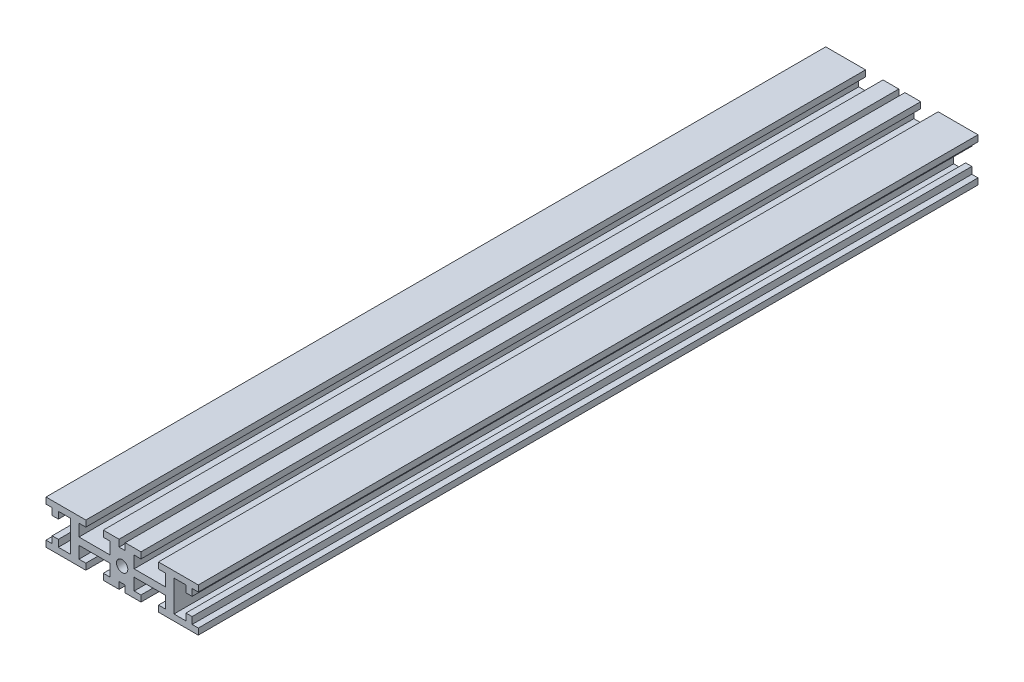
ISO-10303-21;
HEADER;
FILE_DESCRIPTION(('STEP AP214'),'2;1');
FILE_NAME('part.step','',(''),(''),'','','');
FILE_SCHEMA(('AUTOMOTIVE_DESIGN { 1 0 10303 214 1 1 1 1 }'));
ENDSEC;
DATA;
#1=APPLICATION_CONTEXT('core data for automotive mechanical design processes');
#2=APPLICATION_PROTOCOL_DEFINITION('international standard','automotive_design',2000,#1);
#3=PRODUCT_CONTEXT('',#1,'mechanical');
#4=PRODUCT('Part','Part','',(#3));
#5=PRODUCT_RELATED_PRODUCT_CATEGORY('part','',(#4));
#6=PRODUCT_DEFINITION_FORMATION('','',#4);
#7=PRODUCT_DEFINITION_CONTEXT('part definition',#1,'design');
#8=PRODUCT_DEFINITION('design','',#6,#7);
#9=PRODUCT_DEFINITION_SHAPE('','',#8);
#10=(LENGTH_UNIT() NAMED_UNIT(*) SI_UNIT(.MILLI.,.METRE.));
#11=(NAMED_UNIT(*) PLANE_ANGLE_UNIT() SI_UNIT($,.RADIAN.));
#12=(NAMED_UNIT(*) SI_UNIT($,.STERADIAN.) SOLID_ANGLE_UNIT());
#13=UNCERTAINTY_MEASURE_WITH_UNIT(LENGTH_MEASURE(1.E-05),#10,'distance_accuracy_value','');
#14=(GEOMETRIC_REPRESENTATION_CONTEXT(3) GLOBAL_UNCERTAINTY_ASSIGNED_CONTEXT((#13)) GLOBAL_UNIT_ASSIGNED_CONTEXT((#10,
#11,#12)) REPRESENTATION_CONTEXT('',''));
#15=CARTESIAN_POINT('',(0.,0.,0.));
#16=DIRECTION('',(0.,0.,1.));
#17=DIRECTION('',(1.,0.,0.));
#18=AXIS2_PLACEMENT_3D('',#15,#16,#17);
#19=CARTESIAN_POINT('',(5.5,6.35,227.6));
#20=DIRECTION('',(0.,-1.,0.));
#21=DIRECTION('',(0.,0.,-1.));
#22=AXIS2_PLACEMENT_3D('',#19,#20,#21);
#23=PLANE('',#22);
#24=DIRECTION('',(-1.,0.,0.));
#25=VECTOR('',#24,1.);
#26=CARTESIAN_POINT('',(5.5,6.35,0.));
#27=LINE('',#26,#25);
#28=CARTESIAN_POINT('',(5.5,6.35,0.));
#29=VERTEX_POINT('',#28);
#30=CARTESIAN_POINT('',(0.9,6.35,0.));
#31=VERTEX_POINT('',#30);
#32=EDGE_CURVE('E479',#29,#31,#27,.T.);
#33=ORIENTED_EDGE('',*,*,#32,.T.);
#34=DIRECTION('',(0.,0.,1.));
#35=VECTOR('',#34,1.);
#36=CARTESIAN_POINT('',(0.9,6.35,0.));
#37=LINE('',#36,#35);
#38=CARTESIAN_POINT('',(0.9,6.35,227.6));
#39=VERTEX_POINT('',#38);
#40=EDGE_CURVE('E460',#31,#39,#37,.T.);
#41=ORIENTED_EDGE('',*,*,#40,.T.);
#42=DIRECTION('',(-1.,0.,0.));
#43=VECTOR('',#42,1.);
#44=CARTESIAN_POINT('',(5.5,6.35,227.6));
#45=LINE('',#44,#43);
#46=CARTESIAN_POINT('',(5.5,6.35,227.6));
#47=VERTEX_POINT('',#46);
#48=EDGE_CURVE('E821',#47,#39,#45,.T.);
#49=ORIENTED_EDGE('',*,*,#48,.F.);
#50=DIRECTION('',(0.,0.,-1.));
#51=VECTOR('',#50,1.);
#52=CARTESIAN_POINT('',(5.5,6.35,227.6));
#53=LINE('',#52,#51);
#54=EDGE_CURVE('E485',#47,#29,#53,.T.);
#55=ORIENTED_EDGE('',*,*,#54,.T.);
#56=EDGE_LOOP('',(#33,#41,#49,#55));
#57=FACE_BOUND('',#56,.T.);
#58=ADVANCED_FACE('F35',(#57),#23,.F.);
#59=CARTESIAN_POINT('',(-5.5,-6.35,227.6));
#60=DIRECTION('',(0.,1.,0.));
#61=DIRECTION('',(-1.,0.,0.));
#62=AXIS2_PLACEMENT_3D('',#59,#60,#61);
#63=PLANE('',#62);
#64=DIRECTION('',(1.,0.,0.));
#65=VECTOR('',#64,1.);
#66=CARTESIAN_POINT('',(-5.5,-6.35,0.));
#67=LINE('',#66,#65);
#68=CARTESIAN_POINT('',(-5.5,-6.35,0.));
#69=VERTEX_POINT('',#68);
#70=CARTESIAN_POINT('',(-0.899999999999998,-6.35,0.));
#71=VERTEX_POINT('',#70);
#72=EDGE_CURVE('E737',#69,#71,#67,.T.);
#73=ORIENTED_EDGE('',*,*,#72,.T.);
#74=DIRECTION('',(0.,0.,1.));
#75=VECTOR('',#74,1.);
#76=CARTESIAN_POINT('',(-0.899999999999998,-6.35,0.));
#77=LINE('',#76,#75);
#78=CARTESIAN_POINT('',(-0.899999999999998,-6.35,227.6));
#79=VERTEX_POINT('',#78);
#80=EDGE_CURVE('E1083',#71,#79,#77,.T.);
#81=ORIENTED_EDGE('',*,*,#80,.T.);
#82=DIRECTION('',(1.,0.,0.));
#83=VECTOR('',#82,1.);
#84=CARTESIAN_POINT('',(-5.5,-6.35,227.6));
#85=LINE('',#84,#83);
#86=CARTESIAN_POINT('',(-5.5,-6.35,227.6));
#87=VERTEX_POINT('',#86);
#88=EDGE_CURVE('E892',#87,#79,#85,.T.);
#89=ORIENTED_EDGE('',*,*,#88,.F.);
#90=DIRECTION('',(0.,0.,-1.));
#91=VECTOR('',#90,1.);
#92=CARTESIAN_POINT('',(-5.5,-6.35,227.6));
#93=LINE('',#92,#91);
#94=EDGE_CURVE('E680',#87,#69,#93,.T.);
#95=ORIENTED_EDGE('',*,*,#94,.T.);
#96=EDGE_LOOP('',(#73,#81,#89,#95));
#97=FACE_BOUND('',#96,.T.);
#98=ADVANCED_FACE('F1142',(#97),#63,.F.);
#99=CARTESIAN_POINT('',(0.,0.,227.6));
#100=DIRECTION('',(0.,0.,-1.));
#101=DIRECTION('',(-1.,0.,0.));
#102=AXIS2_PLACEMENT_3D('',#99,#100,#101);
#103=PLANE('',#102);
#104=ORIENTED_EDGE('',*,*,#48,.T.);
#105=DIRECTION('',(0.,1.,0.));
#106=VECTOR('',#105,1.);
#107=CARTESIAN_POINT('',(0.9,6.35,227.6));
#108=LINE('',#107,#106);
#109=CARTESIAN_POINT('',(0.9,4.35,227.6));
#110=VERTEX_POINT('',#109);
#111=EDGE_CURVE('E466',#110,#39,#108,.T.);
#112=ORIENTED_EDGE('',*,*,#111,.F.);
#113=DIRECTION('',(1.,0.,0.));
#114=VECTOR('',#113,1.);
#115=CARTESIAN_POINT('',(0.9,4.35,227.6));
#116=LINE('',#115,#114);
#117=CARTESIAN_POINT('',(-0.9,4.35,227.6));
#118=VERTEX_POINT('',#117);
#119=EDGE_CURVE('E481',#118,#110,#116,.T.);
#120=ORIENTED_EDGE('',*,*,#119,.F.);
#121=DIRECTION('',(0.,-1.,0.));
#122=VECTOR('',#121,1.);
#123=CARTESIAN_POINT('',(-0.9,6.35,227.6));
#124=LINE('',#123,#122);
#125=CARTESIAN_POINT('',(-0.9,6.35,227.6));
#126=VERTEX_POINT('',#125);
#127=EDGE_CURVE('E1109',#126,#118,#124,.T.);
#128=ORIENTED_EDGE('',*,*,#127,.F.);
#129=CARTESIAN_POINT('',(-5.5,6.35,227.6));
#130=VERTEX_POINT('',#129);
#131=EDGE_CURVE('E815',#126,#130,#45,.T.);
#132=ORIENTED_EDGE('',*,*,#131,.T.);
#133=DIRECTION('',(0.,-1.,0.));
#134=VECTOR('',#133,1.);
#135=CARTESIAN_POINT('',(-5.5,4.54999999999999,227.6));
#136=LINE('',#135,#134);
#137=CARTESIAN_POINT('',(-5.5,4.54999999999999,227.6));
#138=VERTEX_POINT('',#137);
#139=EDGE_CURVE('E823',#130,#138,#136,.T.);
#140=ORIENTED_EDGE('',*,*,#139,.T.);
#141=DIRECTION('',(1.,0.,0.));
#142=VECTOR('',#141,1.);
#143=CARTESIAN_POINT('',(-3.5,4.54999999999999,227.6));
#144=LINE('',#143,#142);
#145=CARTESIAN_POINT('',(-3.5,4.54999999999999,227.6));
#146=VERTEX_POINT('',#145);
#147=EDGE_CURVE('E825',#138,#146,#144,.T.);
#148=ORIENTED_EDGE('',*,*,#147,.T.);
#149=DIRECTION('',(0.,-1.,0.));
#150=VECTOR('',#149,1.);
#151=CARTESIAN_POINT('',(-3.5,4.54999999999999,227.6));
#152=LINE('',#151,#150);
#153=CARTESIAN_POINT('',(-3.5,1.04999999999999,227.6));
#154=VERTEX_POINT('',#153);
#155=EDGE_CURVE('E827',#146,#154,#152,.T.);
#156=ORIENTED_EDGE('',*,*,#155,.T.);
#157=DIRECTION('',(-1.,0.,0.));
#158=VECTOR('',#157,1.);
#159=CARTESIAN_POINT('',(-3.5,1.04999999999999,227.6));
#160=LINE('',#159,#158);
#161=CARTESIAN_POINT('',(-12.6,1.04999999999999,227.6));
#162=VERTEX_POINT('',#161);
#163=EDGE_CURVE('E829',#154,#162,#160,.T.);
#164=ORIENTED_EDGE('',*,*,#163,.T.);
#165=DIRECTION('',(0.,1.,0.));
#166=VECTOR('',#165,1.);
#167=CARTESIAN_POINT('',(-12.6,1.04999999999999,227.6));
#168=LINE('',#167,#166);
#169=CARTESIAN_POINT('',(-12.6,4.55,227.6));
#170=VERTEX_POINT('',#169);
#171=EDGE_CURVE('E831',#162,#170,#168,.T.);
#172=ORIENTED_EDGE('',*,*,#171,.T.);
#173=DIRECTION('',(1.,0.,0.));
#174=VECTOR('',#173,1.);
#175=CARTESIAN_POINT('',(-12.6,4.55,227.6));
#176=LINE('',#175,#174);
#177=CARTESIAN_POINT('',(-10.6,4.55,227.6));
#178=VERTEX_POINT('',#177);
#179=EDGE_CURVE('E833',#170,#178,#176,.T.);
#180=ORIENTED_EDGE('',*,*,#179,.T.);
#181=DIRECTION('',(0.,1.,0.));
#182=VECTOR('',#181,1.);
#183=CARTESIAN_POINT('',(-10.6,4.55,227.6));
#184=LINE('',#183,#182);
#185=CARTESIAN_POINT('',(-10.6,6.35,227.6));
#186=VERTEX_POINT('',#185);
#187=EDGE_CURVE('E835',#178,#186,#184,.T.);
#188=ORIENTED_EDGE('',*,*,#187,.T.);
#189=DIRECTION('',(-1.,0.,0.));
#190=VECTOR('',#189,1.);
#191=CARTESIAN_POINT('',(-10.6,6.35,227.6));
#192=LINE('',#191,#190);
#193=CARTESIAN_POINT('',(-22.225,6.35,227.6));
#194=VERTEX_POINT('',#193);
#195=EDGE_CURVE('E837',#186,#194,#192,.T.);
#196=ORIENTED_EDGE('',*,*,#195,.T.);
#197=DIRECTION('',(0.,-1.,0.));
#198=VECTOR('',#197,1.);
#199=CARTESIAN_POINT('',(-22.225,6.35,227.6));
#200=LINE('',#199,#198);
#201=CARTESIAN_POINT('',(-22.225,4.55,227.6));
#202=VERTEX_POINT('',#201);
#203=EDGE_CURVE('E839',#194,#202,#200,.T.);
#204=ORIENTED_EDGE('',*,*,#203,.T.);
#205=DIRECTION('',(1.,0.,0.));
#206=VECTOR('',#205,1.);
#207=CARTESIAN_POINT('',(-20.425,4.55,227.6));
#208=LINE('',#207,#206);
#209=CARTESIAN_POINT('',(-20.425,4.55,227.6));
#210=VERTEX_POINT('',#209);
#211=EDGE_CURVE('E841',#202,#210,#208,.T.);
#212=ORIENTED_EDGE('',*,*,#211,.T.);
#213=DIRECTION('',(0.,-1.,0.));
#214=VECTOR('',#213,1.);
#215=CARTESIAN_POINT('',(-20.425,2.55,227.6));
#216=LINE('',#215,#214);
#217=CARTESIAN_POINT('',(-20.425,2.55,227.6));
#218=VERTEX_POINT('',#217);
#219=EDGE_CURVE('E843',#210,#218,#216,.T.);
#220=ORIENTED_EDGE('',*,*,#219,.T.);
#221=DIRECTION('',(1.,0.,0.));
#222=VECTOR('',#221,1.);
#223=CARTESIAN_POINT('',(-18.625,2.55,227.6));
#224=LINE('',#223,#222);
#225=CARTESIAN_POINT('',(-18.625,2.55,227.6));
#226=VERTEX_POINT('',#225);
#227=EDGE_CURVE('E845',#218,#226,#224,.T.);
#228=ORIENTED_EDGE('',*,*,#227,.T.);
#229=DIRECTION('',(0.,1.,0.));
#230=VECTOR('',#229,1.);
#231=CARTESIAN_POINT('',(-18.625,4.55,227.6));
#232=LINE('',#231,#230);
#233=CARTESIAN_POINT('',(-18.625,4.55,227.6));
#234=VERTEX_POINT('',#233);
#235=EDGE_CURVE('E847',#226,#234,#232,.T.);
#236=ORIENTED_EDGE('',*,*,#235,.T.);
#237=DIRECTION('',(1.,0.,0.));
#238=VECTOR('',#237,1.);
#239=CARTESIAN_POINT('',(-15.125,4.55,227.6));
#240=LINE('',#239,#238);
#241=CARTESIAN_POINT('',(-15.125,4.55,227.6));
#242=VERTEX_POINT('',#241);
#243=EDGE_CURVE('E849',#234,#242,#240,.T.);
#244=ORIENTED_EDGE('',*,*,#243,.T.);
#245=DIRECTION('',(0.,-1.,0.));
#246=VECTOR('',#245,1.);
#247=CARTESIAN_POINT('',(-15.125,4.55,227.6));
#248=LINE('',#247,#246);
#249=CARTESIAN_POINT('',(-15.125,-4.55,227.6));
#250=VERTEX_POINT('',#249);
#251=EDGE_CURVE('E851',#242,#250,#248,.T.);
#252=ORIENTED_EDGE('',*,*,#251,.T.);
#253=DIRECTION('',(-1.,0.,0.));
#254=VECTOR('',#253,1.);
#255=CARTESIAN_POINT('',(-18.625,-4.55,227.6));
#256=LINE('',#255,#254);
#257=CARTESIAN_POINT('',(-18.625,-4.55,227.6));
#258=VERTEX_POINT('',#257);
#259=EDGE_CURVE('E853',#250,#258,#256,.T.);
#260=ORIENTED_EDGE('',*,*,#259,.T.);
#261=DIRECTION('',(0.,1.,0.));
#262=VECTOR('',#261,1.);
#263=CARTESIAN_POINT('',(-18.625,-4.55,227.6));
#264=LINE('',#263,#262);
#265=CARTESIAN_POINT('',(-18.625,-2.55,227.6));
#266=VERTEX_POINT('',#265);
#267=EDGE_CURVE('E855',#258,#266,#264,.T.);
#268=ORIENTED_EDGE('',*,*,#267,.T.);
#269=DIRECTION('',(-1.,0.,0.));
#270=VECTOR('',#269,1.);
#271=CARTESIAN_POINT('',(-18.625,-2.55,227.6));
#272=LINE('',#271,#270);
#273=CARTESIAN_POINT('',(-20.425,-2.55,227.6));
#274=VERTEX_POINT('',#273);
#275=EDGE_CURVE('E857',#266,#274,#272,.T.);
#276=ORIENTED_EDGE('',*,*,#275,.T.);
#277=DIRECTION('',(0.,-1.,0.));
#278=VECTOR('',#277,1.);
#279=CARTESIAN_POINT('',(-20.425,-2.55,227.6));
#280=LINE('',#279,#278);
#281=CARTESIAN_POINT('',(-20.425,-4.55,227.6));
#282=VERTEX_POINT('',#281);
#283=EDGE_CURVE('E535',#274,#282,#280,.T.);
#284=ORIENTED_EDGE('',*,*,#283,.T.);
#285=DIRECTION('',(-1.,0.,0.));
#286=VECTOR('',#285,1.);
#287=CARTESIAN_POINT('',(-20.425,-4.55,227.6));
#288=LINE('',#287,#286);
#289=CARTESIAN_POINT('',(-22.225,-4.55,227.6));
#290=VERTEX_POINT('',#289);
#291=EDGE_CURVE('E530',#282,#290,#288,.T.);
#292=ORIENTED_EDGE('',*,*,#291,.T.);
#293=DIRECTION('',(0.,-1.,0.));
#294=VECTOR('',#293,1.);
#295=CARTESIAN_POINT('',(-22.225,-6.35,227.6));
#296=LINE('',#295,#294);
#297=CARTESIAN_POINT('',(-22.225,-6.35,227.6));
#298=VERTEX_POINT('',#297);
#299=EDGE_CURVE('E874',#290,#298,#296,.T.);
#300=ORIENTED_EDGE('',*,*,#299,.T.);
#301=DIRECTION('',(1.,0.,0.));
#302=VECTOR('',#301,1.);
#303=CARTESIAN_POINT('',(-22.225,-6.35,227.6));
#304=LINE('',#303,#302);
#305=CARTESIAN_POINT('',(-10.6,-6.35,227.6));
#306=VERTEX_POINT('',#305);
#307=EDGE_CURVE('E711',#298,#306,#304,.T.);
#308=ORIENTED_EDGE('',*,*,#307,.T.);
#309=DIRECTION('',(0.,1.,0.));
#310=VECTOR('',#309,1.);
#311=CARTESIAN_POINT('',(-10.6,-4.55,227.6));
#312=LINE('',#311,#310);
#313=CARTESIAN_POINT('',(-10.6,-4.55,227.6));
#314=VERTEX_POINT('',#313);
#315=EDGE_CURVE('E877',#306,#314,#312,.T.);
#316=ORIENTED_EDGE('',*,*,#315,.T.);
#317=DIRECTION('',(-1.,0.,0.));
#318=VECTOR('',#317,1.);
#319=CARTESIAN_POINT('',(-12.6,-4.55,227.6));
#320=LINE('',#319,#318);
#321=CARTESIAN_POINT('',(-12.6,-4.55,227.6));
#322=VERTEX_POINT('',#321);
#323=EDGE_CURVE('E879',#314,#322,#320,.T.);
#324=ORIENTED_EDGE('',*,*,#323,.T.);
#325=DIRECTION('',(0.,1.,0.));
#326=VECTOR('',#325,1.);
#327=CARTESIAN_POINT('',(-12.6,-1.05,227.6));
#328=LINE('',#327,#326);
#329=CARTESIAN_POINT('',(-12.6,-1.05,227.6));
#330=VERTEX_POINT('',#329);
#331=EDGE_CURVE('E881',#322,#330,#328,.T.);
#332=ORIENTED_EDGE('',*,*,#331,.T.);
#333=DIRECTION('',(1.,0.,0.));
#334=VECTOR('',#333,1.);
#335=CARTESIAN_POINT('',(-3.5,-1.05,227.6));
#336=LINE('',#335,#334);
#337=CARTESIAN_POINT('',(-3.5,-1.05,227.6));
#338=VERTEX_POINT('',#337);
#339=EDGE_CURVE('E883',#330,#338,#336,.T.);
#340=ORIENTED_EDGE('',*,*,#339,.T.);
#341=DIRECTION('',(0.,-1.,0.));
#342=VECTOR('',#341,1.);
#343=CARTESIAN_POINT('',(-3.5,-4.55,227.6));
#344=LINE('',#343,#342);
#345=CARTESIAN_POINT('',(-3.5,-4.55,227.6));
#346=VERTEX_POINT('',#345);
#347=EDGE_CURVE('E885',#338,#346,#344,.T.);
#348=ORIENTED_EDGE('',*,*,#347,.T.);
#349=DIRECTION('',(-1.,0.,0.));
#350=VECTOR('',#349,1.);
#351=CARTESIAN_POINT('',(-5.5,-4.55,227.6));
#352=LINE('',#351,#350);
#353=CARTESIAN_POINT('',(-5.5,-4.55,227.6));
#354=VERTEX_POINT('',#353);
#355=EDGE_CURVE('E887',#346,#354,#352,.T.);
#356=ORIENTED_EDGE('',*,*,#355,.T.);
#357=DIRECTION('',(0.,-1.,0.));
#358=VECTOR('',#357,1.);
#359=CARTESIAN_POINT('',(-5.5,-4.55,227.6));
#360=LINE('',#359,#358);
#361=EDGE_CURVE('E889',#354,#87,#360,.T.);
#362=ORIENTED_EDGE('',*,*,#361,.T.);
#363=ORIENTED_EDGE('',*,*,#88,.T.);
#364=DIRECTION('',(0.,-1.,0.));
#365=VECTOR('',#364,1.);
#366=CARTESIAN_POINT('',(-0.899999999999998,-6.35,227.6));
#367=LINE('',#366,#365);
#368=CARTESIAN_POINT('',(-0.899999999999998,-4.35,227.6));
#369=VERTEX_POINT('',#368);
#370=EDGE_CURVE('E1096',#369,#79,#367,.T.);
#371=ORIENTED_EDGE('',*,*,#370,.F.);
#372=DIRECTION('',(-1.,0.,0.));
#373=VECTOR('',#372,1.);
#374=CARTESIAN_POINT('',(-0.899999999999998,-4.35,227.6));
#375=LINE('',#374,#373);
#376=CARTESIAN_POINT('',(0.900000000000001,-4.35,227.6));
#377=VERTEX_POINT('',#376);
#378=EDGE_CURVE('E1090',#377,#369,#375,.T.);
#379=ORIENTED_EDGE('',*,*,#378,.F.);
#380=DIRECTION('',(0.,1.,0.));
#381=VECTOR('',#380,1.);
#382=CARTESIAN_POINT('',(0.900000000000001,-6.35,227.6));
#383=LINE('',#382,#381);
#384=CARTESIAN_POINT('',(0.900000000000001,-6.35,227.6));
#385=VERTEX_POINT('',#384);
#386=EDGE_CURVE('E1094',#385,#377,#383,.T.);
#387=ORIENTED_EDGE('',*,*,#386,.F.);
#388=CARTESIAN_POINT('',(5.5,-6.35,227.6));
#389=VERTEX_POINT('',#388);
#390=EDGE_CURVE('E891',#385,#389,#85,.T.);
#391=ORIENTED_EDGE('',*,*,#390,.T.);
#392=DIRECTION('',(0.,1.,0.));
#393=VECTOR('',#392,1.);
#394=CARTESIAN_POINT('',(5.5,-4.55,227.6));
#395=LINE('',#394,#393);
#396=CARTESIAN_POINT('',(5.5,-4.55,227.6));
#397=VERTEX_POINT('',#396);
#398=EDGE_CURVE('E895',#389,#397,#395,.T.);
#399=ORIENTED_EDGE('',*,*,#398,.T.);
#400=DIRECTION('',(-1.,0.,0.));
#401=VECTOR('',#400,1.);
#402=CARTESIAN_POINT('',(5.5,-4.55,227.6));
#403=LINE('',#402,#401);
#404=CARTESIAN_POINT('',(3.5,-4.55,227.6));
#405=VERTEX_POINT('',#404);
#406=EDGE_CURVE('E897',#397,#405,#403,.T.);
#407=ORIENTED_EDGE('',*,*,#406,.T.);
#408=DIRECTION('',(0.,1.,0.));
#409=VECTOR('',#408,1.);
#410=CARTESIAN_POINT('',(3.5,-4.55,227.6));
#411=LINE('',#410,#409);
#412=CARTESIAN_POINT('',(3.5,-1.05,227.6));
#413=VERTEX_POINT('',#412);
#414=EDGE_CURVE('E899',#405,#413,#411,.T.);
#415=ORIENTED_EDGE('',*,*,#414,.T.);
#416=DIRECTION('',(1.,0.,0.));
#417=VECTOR('',#416,1.);
#418=CARTESIAN_POINT('',(3.5,-1.05,227.6));
#419=LINE('',#418,#417);
#420=CARTESIAN_POINT('',(12.6,-1.05,227.6));
#421=VERTEX_POINT('',#420);
#422=EDGE_CURVE('E901',#413,#421,#419,.T.);
#423=ORIENTED_EDGE('',*,*,#422,.T.);
#424=DIRECTION('',(0.,-1.,0.));
#425=VECTOR('',#424,1.);
#426=CARTESIAN_POINT('',(12.6,-1.05,227.6));
#427=LINE('',#426,#425);
#428=CARTESIAN_POINT('',(12.6,-4.55,227.6));
#429=VERTEX_POINT('',#428);
#430=EDGE_CURVE('E903',#421,#429,#427,.T.);
#431=ORIENTED_EDGE('',*,*,#430,.T.);
#432=DIRECTION('',(-1.,0.,0.));
#433=VECTOR('',#432,1.);
#434=CARTESIAN_POINT('',(12.6,-4.55,227.6));
#435=LINE('',#434,#433);
#436=CARTESIAN_POINT('',(10.6,-4.55,227.6));
#437=VERTEX_POINT('',#436);
#438=EDGE_CURVE('E905',#429,#437,#435,.T.);
#439=ORIENTED_EDGE('',*,*,#438,.T.);
#440=DIRECTION('',(0.,-1.,0.));
#441=VECTOR('',#440,1.);
#442=CARTESIAN_POINT('',(10.6,-4.55,227.6));
#443=LINE('',#442,#441);
#444=CARTESIAN_POINT('',(10.6,-6.35,227.6));
#445=VERTEX_POINT('',#444);
#446=EDGE_CURVE('E907',#437,#445,#443,.T.);
#447=ORIENTED_EDGE('',*,*,#446,.T.);
#448=DIRECTION('',(1.,0.,0.));
#449=VECTOR('',#448,1.);
#450=CARTESIAN_POINT('',(22.225,-6.35,227.6));
#451=LINE('',#450,#449);
#452=CARTESIAN_POINT('',(22.225,-6.35,227.6));
#453=VERTEX_POINT('',#452);
#454=EDGE_CURVE('E909',#445,#453,#451,.T.);
#455=ORIENTED_EDGE('',*,*,#454,.T.);
#456=DIRECTION('',(0.,1.,0.));
#457=VECTOR('',#456,1.);
#458=CARTESIAN_POINT('',(22.225,-4.55,227.6));
#459=LINE('',#458,#457);
#460=CARTESIAN_POINT('',(22.225,-4.55,227.6));
#461=VERTEX_POINT('',#460);
#462=EDGE_CURVE('E911',#453,#461,#459,.T.);
#463=ORIENTED_EDGE('',*,*,#462,.T.);
#464=DIRECTION('',(-1.,0.,0.));
#465=VECTOR('',#464,1.);
#466=CARTESIAN_POINT('',(20.425,-4.55,227.6));
#467=LINE('',#466,#465);
#468=CARTESIAN_POINT('',(20.425,-4.55,227.6));
#469=VERTEX_POINT('',#468);
#470=EDGE_CURVE('E913',#461,#469,#467,.T.);
#471=ORIENTED_EDGE('',*,*,#470,.T.);
#472=DIRECTION('',(0.,1.,0.));
#473=VECTOR('',#472,1.);
#474=CARTESIAN_POINT('',(20.425,-2.55,227.6));
#475=LINE('',#474,#473);
#476=CARTESIAN_POINT('',(20.425,-2.55,227.6));
#477=VERTEX_POINT('',#476);
#478=EDGE_CURVE('E915',#469,#477,#475,.T.);
#479=ORIENTED_EDGE('',*,*,#478,.T.);
#480=DIRECTION('',(-1.,0.,0.));
#481=VECTOR('',#480,1.);
#482=CARTESIAN_POINT('',(18.625,-2.55,227.6));
#483=LINE('',#482,#481);
#484=CARTESIAN_POINT('',(18.625,-2.55,227.6));
#485=VERTEX_POINT('',#484);
#486=EDGE_CURVE('E917',#477,#485,#483,.T.);
#487=ORIENTED_EDGE('',*,*,#486,.T.);
#488=DIRECTION('',(0.,-1.,0.));
#489=VECTOR('',#488,1.);
#490=CARTESIAN_POINT('',(18.625,-4.55,227.6));
#491=LINE('',#490,#489);
#492=CARTESIAN_POINT('',(18.625,-4.55,227.6));
#493=VERTEX_POINT('',#492);
#494=EDGE_CURVE('E919',#485,#493,#491,.T.);
#495=ORIENTED_EDGE('',*,*,#494,.T.);
#496=DIRECTION('',(-1.,0.,0.));
#497=VECTOR('',#496,1.);
#498=CARTESIAN_POINT('',(18.625,-4.55,227.6));
#499=LINE('',#498,#497);
#500=CARTESIAN_POINT('',(15.125,-4.55,227.6));
#501=VERTEX_POINT('',#500);
#502=EDGE_CURVE('E921',#493,#501,#499,.T.);
#503=ORIENTED_EDGE('',*,*,#502,.T.);
#504=DIRECTION('',(0.,1.,0.));
#505=VECTOR('',#504,1.);
#506=CARTESIAN_POINT('',(15.125,4.55,227.6));
#507=LINE('',#506,#505);
#508=CARTESIAN_POINT('',(15.125,4.55,227.6));
#509=VERTEX_POINT('',#508);
#510=EDGE_CURVE('E923',#501,#509,#507,.T.);
#511=ORIENTED_EDGE('',*,*,#510,.T.);
#512=DIRECTION('',(1.,0.,0.));
#513=VECTOR('',#512,1.);
#514=CARTESIAN_POINT('',(15.125,4.55,227.6));
#515=LINE('',#514,#513);
#516=CARTESIAN_POINT('',(18.625,4.55,227.6));
#517=VERTEX_POINT('',#516);
#518=EDGE_CURVE('E925',#509,#517,#515,.T.);
#519=ORIENTED_EDGE('',*,*,#518,.T.);
#520=DIRECTION('',(0.,-1.,0.));
#521=VECTOR('',#520,1.);
#522=CARTESIAN_POINT('',(18.625,4.55,227.6));
#523=LINE('',#522,#521);
#524=CARTESIAN_POINT('',(18.625,2.55,227.6));
#525=VERTEX_POINT('',#524);
#526=EDGE_CURVE('E927',#517,#525,#523,.T.);
#527=ORIENTED_EDGE('',*,*,#526,.T.);
#528=DIRECTION('',(1.,0.,0.));
#529=VECTOR('',#528,1.);
#530=CARTESIAN_POINT('',(18.625,2.55,227.6));
#531=LINE('',#530,#529);
#532=CARTESIAN_POINT('',(20.425,2.55,227.6));
#533=VERTEX_POINT('',#532);
#534=EDGE_CURVE('E929',#525,#533,#531,.T.);
#535=ORIENTED_EDGE('',*,*,#534,.T.);
#536=DIRECTION('',(0.,1.,0.));
#537=VECTOR('',#536,1.);
#538=CARTESIAN_POINT('',(20.425,2.55,227.6));
#539=LINE('',#538,#537);
#540=CARTESIAN_POINT('',(20.425,4.55,227.6));
#541=VERTEX_POINT('',#540);
#542=EDGE_CURVE('E931',#533,#541,#539,.T.);
#543=ORIENTED_EDGE('',*,*,#542,.T.);
#544=DIRECTION('',(1.,0.,0.));
#545=VECTOR('',#544,1.);
#546=CARTESIAN_POINT('',(20.425,4.55,227.6));
#547=LINE('',#546,#545);
#548=CARTESIAN_POINT('',(22.225,4.55,227.6));
#549=VERTEX_POINT('',#548);
#550=EDGE_CURVE('E933',#541,#549,#547,.T.);
#551=ORIENTED_EDGE('',*,*,#550,.T.);
#552=DIRECTION('',(0.,1.,0.));
#553=VECTOR('',#552,1.);
#554=CARTESIAN_POINT('',(22.225,4.55,227.6));
#555=LINE('',#554,#553);
#556=CARTESIAN_POINT('',(22.225,6.35,227.6));
#557=VERTEX_POINT('',#556);
#558=EDGE_CURVE('E935',#549,#557,#555,.T.);
#559=ORIENTED_EDGE('',*,*,#558,.T.);
#560=DIRECTION('',(-1.,0.,0.));
#561=VECTOR('',#560,1.);
#562=CARTESIAN_POINT('',(10.6,6.35,227.6));
#563=LINE('',#562,#561);
#564=CARTESIAN_POINT('',(10.6,6.35,227.6));
#565=VERTEX_POINT('',#564);
#566=EDGE_CURVE('E937',#557,#565,#563,.T.);
#567=ORIENTED_EDGE('',*,*,#566,.T.);
#568=DIRECTION('',(0.,-1.,0.));
#569=VECTOR('',#568,1.);
#570=CARTESIAN_POINT('',(10.6,4.55,227.6));
#571=LINE('',#570,#569);
#572=CARTESIAN_POINT('',(10.6,4.55,227.6));
#573=VERTEX_POINT('',#572);
#574=EDGE_CURVE('E939',#565,#573,#571,.T.);
#575=ORIENTED_EDGE('',*,*,#574,.T.);
#576=DIRECTION('',(1.,0.,0.));
#577=VECTOR('',#576,1.);
#578=CARTESIAN_POINT('',(12.6,4.55,227.6));
#579=LINE('',#578,#577);
#580=CARTESIAN_POINT('',(12.6,4.55,227.6));
#581=VERTEX_POINT('',#580);
#582=EDGE_CURVE('E941',#573,#581,#579,.T.);
#583=ORIENTED_EDGE('',*,*,#582,.T.);
#584=DIRECTION('',(0.,-1.,0.));
#585=VECTOR('',#584,1.);
#586=CARTESIAN_POINT('',(12.6,1.04999999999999,227.6));
#587=LINE('',#586,#585);
#588=CARTESIAN_POINT('',(12.6,1.04999999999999,227.6));
#589=VERTEX_POINT('',#588);
#590=EDGE_CURVE('E943',#581,#589,#587,.T.);
#591=ORIENTED_EDGE('',*,*,#590,.T.);
#592=DIRECTION('',(-1.,0.,0.));
#593=VECTOR('',#592,1.);
#594=CARTESIAN_POINT('',(3.5,1.04999999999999,227.6));
#595=LINE('',#594,#593);
#596=CARTESIAN_POINT('',(3.5,1.04999999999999,227.6));
#597=VERTEX_POINT('',#596);
#598=EDGE_CURVE('E817',#589,#597,#595,.T.);
#599=ORIENTED_EDGE('',*,*,#598,.T.);
#600=DIRECTION('',(0.,1.,0.));
#601=VECTOR('',#600,1.);
#602=CARTESIAN_POINT('',(3.5,4.54999999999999,227.6));
#603=LINE('',#602,#601);
#604=CARTESIAN_POINT('',(3.5,4.54999999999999,227.6));
#605=VERTEX_POINT('',#604);
#606=EDGE_CURVE('E813',#597,#605,#603,.T.);
#607=ORIENTED_EDGE('',*,*,#606,.T.);
#608=DIRECTION('',(1.,0.,0.));
#609=VECTOR('',#608,1.);
#610=CARTESIAN_POINT('',(3.5,4.54999999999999,227.6));
#611=LINE('',#610,#609);
#612=CARTESIAN_POINT('',(5.5,4.54999999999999,227.6));
#613=VERTEX_POINT('',#612);
#614=EDGE_CURVE('E810',#605,#613,#611,.T.);
#615=ORIENTED_EDGE('',*,*,#614,.T.);
#616=DIRECTION('',(0.,1.,0.));
#617=VECTOR('',#616,1.);
#618=CARTESIAN_POINT('',(5.5,4.54999999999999,227.6));
#619=LINE('',#618,#617);
#620=EDGE_CURVE('E812',#613,#47,#619,.T.);
#621=ORIENTED_EDGE('',*,*,#620,.T.);
#622=EDGE_LOOP('',(#104,#112,#120,#128,#132,#140,#148,#156,#164,#172,#180,#188,#196,#204,#212,
#220,#228,#236,#244,#252,#260,#268,#276,#284,#292,#300,#308,#316,#324,#332,#340,#348,#356,#362,
#363,#371,#379,#387,#391,#399,#407,#415,#423,#431,#439,#447,#455,#463,#471,#479,#487,#495,#503,
#511,#519,#527,#535,#543,#551,#559,#567,#575,#583,#591,#599,#607,#615,#621));
#623=FACE_BOUND('',#622,.T.);
#624=CARTESIAN_POINT('',(0.,0.,227.6));
#625=DIRECTION('',(0.,0.,1.));
#626=DIRECTION('',(1.,0.,0.));
#627=AXIS2_PLACEMENT_3D('',#624,#625,#626);
#628=CIRCLE('',#627,1.64999999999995);
#629=CARTESIAN_POINT('',(1.64999999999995,0.,227.6));
#630=VERTEX_POINT('',#629);
#631=EDGE_CURVE('E864',#630,#630,#628,.T.);
#632=ORIENTED_EDGE('',*,*,#631,.F.);
#633=EDGE_LOOP('',(#632));
#634=FACE_BOUND('',#633,.T.);
#635=ADVANCED_FACE('F945',(#623,#634),#103,.F.);
#636=CARTESIAN_POINT('',(0.,0.,0.));
#637=DIRECTION('',(0.,0.,-1.));
#638=DIRECTION('',(-1.,0.,0.));
#639=AXIS2_PLACEMENT_3D('',#636,#637,#638);
#640=PLANE('',#639);
#641=DIRECTION('',(0.,1.,0.));
#642=VECTOR('',#641,1.);
#643=CARTESIAN_POINT('',(0.9,6.35,0.));
#644=LINE('',#643,#642);
#645=CARTESIAN_POINT('',(0.9,4.35,0.));
#646=VERTEX_POINT('',#645);
#647=EDGE_CURVE('E463',#646,#31,#644,.T.);
#648=ORIENTED_EDGE('',*,*,#647,.T.);
#649=ORIENTED_EDGE('',*,*,#32,.F.);
#650=DIRECTION('',(0.,1.,0.));
#651=VECTOR('',#650,1.);
#652=CARTESIAN_POINT('',(5.5,4.54999999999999,0.));
#653=LINE('',#652,#651);
#654=CARTESIAN_POINT('',(5.5,4.54999999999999,0.));
#655=VERTEX_POINT('',#654);
#656=EDGE_CURVE('E491',#655,#29,#653,.T.);
#657=ORIENTED_EDGE('',*,*,#656,.F.);
#658=DIRECTION('',(1.,0.,0.));
#659=VECTOR('',#658,1.);
#660=CARTESIAN_POINT('',(3.5,4.54999999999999,0.));
#661=LINE('',#660,#659);
#662=CARTESIAN_POINT('',(3.5,4.54999999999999,0.));
#663=VERTEX_POINT('',#662);
#664=EDGE_CURVE('E793',#663,#655,#661,.T.);
#665=ORIENTED_EDGE('',*,*,#664,.F.);
#666=DIRECTION('',(0.,1.,0.));
#667=VECTOR('',#666,1.);
#668=CARTESIAN_POINT('',(3.5,4.54999999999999,0.));
#669=LINE('',#668,#667);
#670=CARTESIAN_POINT('',(3.5,1.04999999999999,0.));
#671=VERTEX_POINT('',#670);
#672=EDGE_CURVE('E792',#671,#663,#669,.T.);
#673=ORIENTED_EDGE('',*,*,#672,.F.);
#674=DIRECTION('',(-1.,0.,0.));
#675=VECTOR('',#674,1.);
#676=CARTESIAN_POINT('',(3.5,1.04999999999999,0.));
#677=LINE('',#676,#675);
#678=CARTESIAN_POINT('',(12.6,1.04999999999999,0.));
#679=VERTEX_POINT('',#678);
#680=EDGE_CURVE('E790',#679,#671,#677,.T.);
#681=ORIENTED_EDGE('',*,*,#680,.F.);
#682=DIRECTION('',(0.,-1.,0.));
#683=VECTOR('',#682,1.);
#684=CARTESIAN_POINT('',(12.6,1.04999999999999,0.));
#685=LINE('',#684,#683);
#686=CARTESIAN_POINT('',(12.6,4.55,0.));
#687=VERTEX_POINT('',#686);
#688=EDGE_CURVE('E788',#687,#679,#685,.T.);
#689=ORIENTED_EDGE('',*,*,#688,.F.);
#690=DIRECTION('',(1.,0.,0.));
#691=VECTOR('',#690,1.);
#692=CARTESIAN_POINT('',(12.6,4.55,0.));
#693=LINE('',#692,#691);
#694=CARTESIAN_POINT('',(10.6,4.55,0.));
#695=VERTEX_POINT('',#694);
#696=EDGE_CURVE('E786',#695,#687,#693,.T.);
#697=ORIENTED_EDGE('',*,*,#696,.F.);
#698=DIRECTION('',(0.,-1.,0.));
#699=VECTOR('',#698,1.);
#700=CARTESIAN_POINT('',(10.6,4.55,0.));
#701=LINE('',#700,#699);
#702=CARTESIAN_POINT('',(10.6,6.35,0.));
#703=VERTEX_POINT('',#702);
#704=EDGE_CURVE('E784',#703,#695,#701,.T.);
#705=ORIENTED_EDGE('',*,*,#704,.F.);
#706=DIRECTION('',(-1.,0.,0.));
#707=VECTOR('',#706,1.);
#708=CARTESIAN_POINT('',(10.6,6.35,0.));
#709=LINE('',#708,#707);
#710=CARTESIAN_POINT('',(22.225,6.35,0.));
#711=VERTEX_POINT('',#710);
#712=EDGE_CURVE('E782',#711,#703,#709,.T.);
#713=ORIENTED_EDGE('',*,*,#712,.F.);
#714=DIRECTION('',(0.,1.,0.));
#715=VECTOR('',#714,1.);
#716=CARTESIAN_POINT('',(22.225,4.55,0.));
#717=LINE('',#716,#715);
#718=CARTESIAN_POINT('',(22.225,4.55,0.));
#719=VERTEX_POINT('',#718);
#720=EDGE_CURVE('E780',#719,#711,#717,.T.);
#721=ORIENTED_EDGE('',*,*,#720,.F.);
#722=DIRECTION('',(1.,0.,0.));
#723=VECTOR('',#722,1.);
#724=CARTESIAN_POINT('',(20.425,4.55,0.));
#725=LINE('',#724,#723);
#726=CARTESIAN_POINT('',(20.425,4.55,0.));
#727=VERTEX_POINT('',#726);
#728=EDGE_CURVE('E778',#727,#719,#725,.T.);
#729=ORIENTED_EDGE('',*,*,#728,.F.);
#730=DIRECTION('',(0.,1.,0.));
#731=VECTOR('',#730,1.);
#732=CARTESIAN_POINT('',(20.425,2.55,0.));
#733=LINE('',#732,#731);
#734=CARTESIAN_POINT('',(20.425,2.55,0.));
#735=VERTEX_POINT('',#734);
#736=EDGE_CURVE('E776',#735,#727,#733,.T.);
#737=ORIENTED_EDGE('',*,*,#736,.F.);
#738=DIRECTION('',(1.,0.,0.));
#739=VECTOR('',#738,1.);
#740=CARTESIAN_POINT('',(18.625,2.55,0.));
#741=LINE('',#740,#739);
#742=CARTESIAN_POINT('',(18.625,2.55,0.));
#743=VERTEX_POINT('',#742);
#744=EDGE_CURVE('E774',#743,#735,#741,.T.);
#745=ORIENTED_EDGE('',*,*,#744,.F.);
#746=DIRECTION('',(0.,-1.,0.));
#747=VECTOR('',#746,1.);
#748=CARTESIAN_POINT('',(18.625,4.55,0.));
#749=LINE('',#748,#747);
#750=CARTESIAN_POINT('',(18.625,4.55,0.));
#751=VERTEX_POINT('',#750);
#752=EDGE_CURVE('E772',#751,#743,#749,.T.);
#753=ORIENTED_EDGE('',*,*,#752,.F.);
#754=DIRECTION('',(1.,0.,0.));
#755=VECTOR('',#754,1.);
#756=CARTESIAN_POINT('',(15.125,4.55,0.));
#757=LINE('',#756,#755);
#758=CARTESIAN_POINT('',(15.125,4.55,0.));
#759=VERTEX_POINT('',#758);
#760=EDGE_CURVE('E770',#759,#751,#757,.T.);
#761=ORIENTED_EDGE('',*,*,#760,.F.);
#762=DIRECTION('',(0.,1.,0.));
#763=VECTOR('',#762,1.);
#764=CARTESIAN_POINT('',(15.125,4.55,0.));
#765=LINE('',#764,#763);
#766=CARTESIAN_POINT('',(15.125,-4.55,0.));
#767=VERTEX_POINT('',#766);
#768=EDGE_CURVE('E768',#767,#759,#765,.T.);
#769=ORIENTED_EDGE('',*,*,#768,.F.);
#770=DIRECTION('',(-1.,0.,0.));
#771=VECTOR('',#770,1.);
#772=CARTESIAN_POINT('',(18.625,-4.55,0.));
#773=LINE('',#772,#771);
#774=CARTESIAN_POINT('',(18.625,-4.55,0.));
#775=VERTEX_POINT('',#774);
#776=EDGE_CURVE('E766',#775,#767,#773,.T.);
#777=ORIENTED_EDGE('',*,*,#776,.F.);
#778=DIRECTION('',(0.,-1.,0.));
#779=VECTOR('',#778,1.);
#780=CARTESIAN_POINT('',(18.625,-4.55,0.));
#781=LINE('',#780,#779);
#782=CARTESIAN_POINT('',(18.625,-2.55,0.));
#783=VERTEX_POINT('',#782);
#784=EDGE_CURVE('E764',#783,#775,#781,.T.);
#785=ORIENTED_EDGE('',*,*,#784,.F.);
#786=DIRECTION('',(-1.,0.,0.));
#787=VECTOR('',#786,1.);
#788=CARTESIAN_POINT('',(18.625,-2.55,0.));
#789=LINE('',#788,#787);
#790=CARTESIAN_POINT('',(20.425,-2.55,0.));
#791=VERTEX_POINT('',#790);
#792=EDGE_CURVE('E762',#791,#783,#789,.T.);
#793=ORIENTED_EDGE('',*,*,#792,.F.);
#794=DIRECTION('',(0.,1.,0.));
#795=VECTOR('',#794,1.);
#796=CARTESIAN_POINT('',(20.425,-2.55,0.));
#797=LINE('',#796,#795);
#798=CARTESIAN_POINT('',(20.425,-4.55,0.));
#799=VERTEX_POINT('',#798);
#800=EDGE_CURVE('E760',#799,#791,#797,.T.);
#801=ORIENTED_EDGE('',*,*,#800,.F.);
#802=DIRECTION('',(-1.,0.,0.));
#803=VECTOR('',#802,1.);
#804=CARTESIAN_POINT('',(20.425,-4.55,0.));
#805=LINE('',#804,#803);
#806=CARTESIAN_POINT('',(22.225,-4.55,0.));
#807=VERTEX_POINT('',#806);
#808=EDGE_CURVE('E758',#807,#799,#805,.T.);
#809=ORIENTED_EDGE('',*,*,#808,.F.);
#810=DIRECTION('',(0.,1.,0.));
#811=VECTOR('',#810,1.);
#812=CARTESIAN_POINT('',(22.225,-4.55,0.));
#813=LINE('',#812,#811);
#814=CARTESIAN_POINT('',(22.225,-6.35,0.));
#815=VERTEX_POINT('',#814);
#816=EDGE_CURVE('E756',#815,#807,#813,.T.);
#817=ORIENTED_EDGE('',*,*,#816,.F.);
#818=DIRECTION('',(1.,0.,0.));
#819=VECTOR('',#818,1.);
#820=CARTESIAN_POINT('',(22.225,-6.35,0.));
#821=LINE('',#820,#819);
#822=CARTESIAN_POINT('',(10.6,-6.35,0.));
#823=VERTEX_POINT('',#822);
#824=EDGE_CURVE('E754',#823,#815,#821,.T.);
#825=ORIENTED_EDGE('',*,*,#824,.F.);
#826=DIRECTION('',(0.,-1.,0.));
#827=VECTOR('',#826,1.);
#828=CARTESIAN_POINT('',(10.6,-4.55,0.));
#829=LINE('',#828,#827);
#830=CARTESIAN_POINT('',(10.6,-4.55,0.));
#831=VERTEX_POINT('',#830);
#832=EDGE_CURVE('E752',#831,#823,#829,.T.);
#833=ORIENTED_EDGE('',*,*,#832,.F.);
#834=DIRECTION('',(-1.,0.,0.));
#835=VECTOR('',#834,1.);
#836=CARTESIAN_POINT('',(12.6,-4.55,0.));
#837=LINE('',#836,#835);
#838=CARTESIAN_POINT('',(12.6,-4.55,0.));
#839=VERTEX_POINT('',#838);
#840=EDGE_CURVE('E750',#839,#831,#837,.T.);
#841=ORIENTED_EDGE('',*,*,#840,.F.);
#842=DIRECTION('',(0.,-1.,0.));
#843=VECTOR('',#842,1.);
#844=CARTESIAN_POINT('',(12.6,-1.05,0.));
#845=LINE('',#844,#843);
#846=CARTESIAN_POINT('',(12.6,-1.05,0.));
#847=VERTEX_POINT('',#846);
#848=EDGE_CURVE('E748',#847,#839,#845,.T.);
#849=ORIENTED_EDGE('',*,*,#848,.F.);
#850=DIRECTION('',(1.,0.,0.));
#851=VECTOR('',#850,1.);
#852=CARTESIAN_POINT('',(3.5,-1.05,0.));
#853=LINE('',#852,#851);
#854=CARTESIAN_POINT('',(3.5,-1.05,0.));
#855=VERTEX_POINT('',#854);
#856=EDGE_CURVE('E746',#855,#847,#853,.T.);
#857=ORIENTED_EDGE('',*,*,#856,.F.);
#858=DIRECTION('',(0.,1.,0.));
#859=VECTOR('',#858,1.);
#860=CARTESIAN_POINT('',(3.5,-4.55,0.));
#861=LINE('',#860,#859);
#862=CARTESIAN_POINT('',(3.5,-4.55,0.));
#863=VERTEX_POINT('',#862);
#864=EDGE_CURVE('E744',#863,#855,#861,.T.);
#865=ORIENTED_EDGE('',*,*,#864,.F.);
#866=DIRECTION('',(-1.,0.,0.));
#867=VECTOR('',#866,1.);
#868=CARTESIAN_POINT('',(5.5,-4.55,0.));
#869=LINE('',#868,#867);
#870=CARTESIAN_POINT('',(5.5,-4.55,0.));
#871=VERTEX_POINT('',#870);
#872=EDGE_CURVE('E742',#871,#863,#869,.T.);
#873=ORIENTED_EDGE('',*,*,#872,.F.);
#874=DIRECTION('',(0.,1.,0.));
#875=VECTOR('',#874,1.);
#876=CARTESIAN_POINT('',(5.5,-4.55,0.));
#877=LINE('',#876,#875);
#878=CARTESIAN_POINT('',(5.5,-6.35,0.));
#879=VERTEX_POINT('',#878);
#880=EDGE_CURVE('E740',#879,#871,#877,.T.);
#881=ORIENTED_EDGE('',*,*,#880,.F.);
#882=CARTESIAN_POINT('',(0.900000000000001,-6.35,0.));
#883=VERTEX_POINT('',#882);
#884=EDGE_CURVE('E736',#883,#879,#67,.T.);
#885=ORIENTED_EDGE('',*,*,#884,.F.);
#886=DIRECTION('',(0.,1.,0.));
#887=VECTOR('',#886,1.);
#888=CARTESIAN_POINT('',(0.900000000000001,-6.35,0.));
#889=LINE('',#888,#887);
#890=CARTESIAN_POINT('',(0.900000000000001,-4.35,0.));
#891=VERTEX_POINT('',#890);
#892=EDGE_CURVE('E58',#883,#891,#889,.T.);
#893=ORIENTED_EDGE('',*,*,#892,.T.);
#894=DIRECTION('',(-1.,0.,0.));
#895=VECTOR('',#894,1.);
#896=CARTESIAN_POINT('',(-0.899999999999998,-4.35,0.));
#897=LINE('',#896,#895);
#898=CARTESIAN_POINT('',(-0.899999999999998,-4.35,0.));
#899=VERTEX_POINT('',#898);
#900=EDGE_CURVE('E1087',#891,#899,#897,.T.);
#901=ORIENTED_EDGE('',*,*,#900,.T.);
#902=DIRECTION('',(0.,-1.,0.));
#903=VECTOR('',#902,1.);
#904=CARTESIAN_POINT('',(-0.899999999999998,-6.35,0.));
#905=LINE('',#904,#903);
#906=EDGE_CURVE('E1093',#899,#71,#905,.T.);
#907=ORIENTED_EDGE('',*,*,#906,.T.);
#908=ORIENTED_EDGE('',*,*,#72,.F.);
#909=DIRECTION('',(0.,-1.,0.));
#910=VECTOR('',#909,1.);
#911=CARTESIAN_POINT('',(-5.5,-4.55,0.));
#912=LINE('',#911,#910);
#913=CARTESIAN_POINT('',(-5.5,-4.55,0.));
#914=VERTEX_POINT('',#913);
#915=EDGE_CURVE('E734',#914,#69,#912,.T.);
#916=ORIENTED_EDGE('',*,*,#915,.F.);
#917=DIRECTION('',(-1.,0.,0.));
#918=VECTOR('',#917,1.);
#919=CARTESIAN_POINT('',(-5.5,-4.55,0.));
#920=LINE('',#919,#918);
#921=CARTESIAN_POINT('',(-3.5,-4.55,0.));
#922=VERTEX_POINT('',#921);
#923=EDGE_CURVE('E732',#922,#914,#920,.T.);
#924=ORIENTED_EDGE('',*,*,#923,.F.);
#925=DIRECTION('',(0.,-1.,0.));
#926=VECTOR('',#925,1.);
#927=CARTESIAN_POINT('',(-3.5,-4.55,0.));
#928=LINE('',#927,#926);
#929=CARTESIAN_POINT('',(-3.5,-1.05,0.));
#930=VERTEX_POINT('',#929);
#931=EDGE_CURVE('E730',#930,#922,#928,.T.);
#932=ORIENTED_EDGE('',*,*,#931,.F.);
#933=DIRECTION('',(1.,0.,0.));
#934=VECTOR('',#933,1.);
#935=CARTESIAN_POINT('',(-3.5,-1.05,0.));
#936=LINE('',#935,#934);
#937=CARTESIAN_POINT('',(-12.6,-1.05,0.));
#938=VERTEX_POINT('',#937);
#939=EDGE_CURVE('E728',#938,#930,#936,.T.);
#940=ORIENTED_EDGE('',*,*,#939,.F.);
#941=DIRECTION('',(0.,1.,0.));
#942=VECTOR('',#941,1.);
#943=CARTESIAN_POINT('',(-12.6,-1.05,0.));
#944=LINE('',#943,#942);
#945=CARTESIAN_POINT('',(-12.6,-4.55,0.));
#946=VERTEX_POINT('',#945);
#947=EDGE_CURVE('E726',#946,#938,#944,.T.);
#948=ORIENTED_EDGE('',*,*,#947,.F.);
#949=DIRECTION('',(-1.,0.,0.));
#950=VECTOR('',#949,1.);
#951=CARTESIAN_POINT('',(-12.6,-4.55,0.));
#952=LINE('',#951,#950);
#953=CARTESIAN_POINT('',(-10.6,-4.55,0.));
#954=VERTEX_POINT('',#953);
#955=EDGE_CURVE('E719',#954,#946,#952,.T.);
#956=ORIENTED_EDGE('',*,*,#955,.F.);
#957=DIRECTION('',(0.,1.,0.));
#958=VECTOR('',#957,1.);
#959=CARTESIAN_POINT('',(-10.6,-4.55,0.));
#960=LINE('',#959,#958);
#961=CARTESIAN_POINT('',(-10.6,-6.35,0.));
#962=VERTEX_POINT('',#961);
#963=EDGE_CURVE('E717',#962,#954,#960,.T.);
#964=ORIENTED_EDGE('',*,*,#963,.F.);
#965=DIRECTION('',(1.,0.,0.));
#966=VECTOR('',#965,1.);
#967=CARTESIAN_POINT('',(-22.225,-6.35,0.));
#968=LINE('',#967,#966);
#969=CARTESIAN_POINT('',(-22.225,-6.35,0.));
#970=VERTEX_POINT('',#969);
#971=EDGE_CURVE('E710',#970,#962,#968,.T.);
#972=ORIENTED_EDGE('',*,*,#971,.F.);
#973=DIRECTION('',(0.,-1.,0.));
#974=VECTOR('',#973,1.);
#975=CARTESIAN_POINT('',(-22.225,-6.35,0.));
#976=LINE('',#975,#974);
#977=CARTESIAN_POINT('',(-22.225,-4.55,0.));
#978=VERTEX_POINT('',#977);
#979=EDGE_CURVE('E715',#978,#970,#976,.T.);
#980=ORIENTED_EDGE('',*,*,#979,.F.);
#981=DIRECTION('',(-1.,0.,0.));
#982=VECTOR('',#981,1.);
#983=CARTESIAN_POINT('',(-20.425,-4.55,0.));
#984=LINE('',#983,#982);
#985=CARTESIAN_POINT('',(-20.425,-4.55,0.));
#986=VERTEX_POINT('',#985);
#987=EDGE_CURVE('E721',#986,#978,#984,.T.);
#988=ORIENTED_EDGE('',*,*,#987,.F.);
#989=DIRECTION('',(0.,-1.,0.));
#990=VECTOR('',#989,1.);
#991=CARTESIAN_POINT('',(-20.425,-2.55,0.));
#992=LINE('',#991,#990);
#993=CARTESIAN_POINT('',(-20.425,-2.55,0.));
#994=VERTEX_POINT('',#993);
#995=EDGE_CURVE('E528',#994,#986,#992,.T.);
#996=ORIENTED_EDGE('',*,*,#995,.F.);
#997=DIRECTION('',(-1.,0.,0.));
#998=VECTOR('',#997,1.);
#999=CARTESIAN_POINT('',(-18.625,-2.55,0.));
#1000=LINE('',#999,#998);
#1001=CARTESIAN_POINT('',(-18.625,-2.55,0.));
#1002=VERTEX_POINT('',#1001);
#1003=EDGE_CURVE('E526',#1002,#994,#1000,.T.);
#1004=ORIENTED_EDGE('',*,*,#1003,.F.);
#1005=DIRECTION('',(0.,1.,0.));
#1006=VECTOR('',#1005,1.);
#1007=CARTESIAN_POINT('',(-18.625,-4.55,0.));
#1008=LINE('',#1007,#1006);
#1009=CARTESIAN_POINT('',(-18.625,-4.55,0.));
#1010=VERTEX_POINT('',#1009);
#1011=EDGE_CURVE('E524',#1010,#1002,#1008,.T.);
#1012=ORIENTED_EDGE('',*,*,#1011,.F.);
#1013=DIRECTION('',(-1.,0.,0.));
#1014=VECTOR('',#1013,1.);
#1015=CARTESIAN_POINT('',(-18.625,-4.55,0.));
#1016=LINE('',#1015,#1014);
#1017=CARTESIAN_POINT('',(-15.125,-4.55,0.));
#1018=VERTEX_POINT('',#1017);
#1019=EDGE_CURVE('E522',#1018,#1010,#1016,.T.);
#1020=ORIENTED_EDGE('',*,*,#1019,.F.);
#1021=DIRECTION('',(0.,-1.,0.));
#1022=VECTOR('',#1021,1.);
#1023=CARTESIAN_POINT('',(-15.125,4.55,0.));
#1024=LINE('',#1023,#1022);
#1025=CARTESIAN_POINT('',(-15.125,4.55,0.));
#1026=VERTEX_POINT('',#1025);
#1027=EDGE_CURVE('E520',#1026,#1018,#1024,.T.);
#1028=ORIENTED_EDGE('',*,*,#1027,.F.);
#1029=DIRECTION('',(1.,0.,0.));
#1030=VECTOR('',#1029,1.);
#1031=CARTESIAN_POINT('',(-15.125,4.55,0.));
#1032=LINE('',#1031,#1030);
#1033=CARTESIAN_POINT('',(-18.625,4.55,0.));
#1034=VERTEX_POINT('',#1033);
#1035=EDGE_CURVE('E518',#1034,#1026,#1032,.T.);
#1036=ORIENTED_EDGE('',*,*,#1035,.F.);
#1037=DIRECTION('',(0.,1.,0.));
#1038=VECTOR('',#1037,1.);
#1039=CARTESIAN_POINT('',(-18.625,4.55,0.));
#1040=LINE('',#1039,#1038);
#1041=CARTESIAN_POINT('',(-18.625,2.55,0.));
#1042=VERTEX_POINT('',#1041);
#1043=EDGE_CURVE('E516',#1042,#1034,#1040,.T.);
#1044=ORIENTED_EDGE('',*,*,#1043,.F.);
#1045=DIRECTION('',(1.,0.,0.));
#1046=VECTOR('',#1045,1.);
#1047=CARTESIAN_POINT('',(-18.625,2.55,0.));
#1048=LINE('',#1047,#1046);
#1049=CARTESIAN_POINT('',(-20.425,2.55,0.));
#1050=VERTEX_POINT('',#1049);
#1051=EDGE_CURVE('E514',#1050,#1042,#1048,.T.);
#1052=ORIENTED_EDGE('',*,*,#1051,.F.);
#1053=DIRECTION('',(0.,-1.,0.));
#1054=VECTOR('',#1053,1.);
#1055=CARTESIAN_POINT('',(-20.425,2.55,0.));
#1056=LINE('',#1055,#1054);
#1057=CARTESIAN_POINT('',(-20.425,4.55,0.));
#1058=VERTEX_POINT('',#1057);
#1059=EDGE_CURVE('E512',#1058,#1050,#1056,.T.);
#1060=ORIENTED_EDGE('',*,*,#1059,.F.);
#1061=DIRECTION('',(1.,0.,0.));
#1062=VECTOR('',#1061,1.);
#1063=CARTESIAN_POINT('',(-20.425,4.55,0.));
#1064=LINE('',#1063,#1062);
#1065=CARTESIAN_POINT('',(-22.225,4.55,0.));
#1066=VERTEX_POINT('',#1065);
#1067=EDGE_CURVE('E510',#1066,#1058,#1064,.T.);
#1068=ORIENTED_EDGE('',*,*,#1067,.F.);
#1069=DIRECTION('',(0.,-1.,0.));
#1070=VECTOR('',#1069,1.);
#1071=CARTESIAN_POINT('',(-22.225,6.35,0.));
#1072=LINE('',#1071,#1070);
#1073=CARTESIAN_POINT('',(-22.225,6.35,0.));
#1074=VERTEX_POINT('',#1073);
#1075=EDGE_CURVE('E508',#1074,#1066,#1072,.T.);
#1076=ORIENTED_EDGE('',*,*,#1075,.F.);
#1077=DIRECTION('',(-1.,0.,0.));
#1078=VECTOR('',#1077,1.);
#1079=CARTESIAN_POINT('',(-10.6,6.35,0.));
#1080=LINE('',#1079,#1078);
#1081=CARTESIAN_POINT('',(-10.6,6.35,0.));
#1082=VERTEX_POINT('',#1081);
#1083=EDGE_CURVE('E506',#1082,#1074,#1080,.T.);
#1084=ORIENTED_EDGE('',*,*,#1083,.F.);
#1085=DIRECTION('',(0.,1.,0.));
#1086=VECTOR('',#1085,1.);
#1087=CARTESIAN_POINT('',(-10.6,4.55,0.));
#1088=LINE('',#1087,#1086);
#1089=CARTESIAN_POINT('',(-10.6,4.55,0.));
#1090=VERTEX_POINT('',#1089);
#1091=EDGE_CURVE('E504',#1090,#1082,#1088,.T.);
#1092=ORIENTED_EDGE('',*,*,#1091,.F.);
#1093=DIRECTION('',(1.,0.,0.));
#1094=VECTOR('',#1093,1.);
#1095=CARTESIAN_POINT('',(-12.6,4.55,0.));
#1096=LINE('',#1095,#1094);
#1097=CARTESIAN_POINT('',(-12.6,4.55,0.));
#1098=VERTEX_POINT('',#1097);
#1099=EDGE_CURVE('E502',#1098,#1090,#1096,.T.);
#1100=ORIENTED_EDGE('',*,*,#1099,.F.);
#1101=DIRECTION('',(0.,1.,0.));
#1102=VECTOR('',#1101,1.);
#1103=CARTESIAN_POINT('',(-12.6,1.04999999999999,0.));
#1104=LINE('',#1103,#1102);
#1105=CARTESIAN_POINT('',(-12.6,1.04999999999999,0.));
#1106=VERTEX_POINT('',#1105);
#1107=EDGE_CURVE('E500',#1106,#1098,#1104,.T.);
#1108=ORIENTED_EDGE('',*,*,#1107,.F.);
#1109=DIRECTION('',(-1.,0.,0.));
#1110=VECTOR('',#1109,1.);
#1111=CARTESIAN_POINT('',(-3.5,1.04999999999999,0.));
#1112=LINE('',#1111,#1110);
#1113=CARTESIAN_POINT('',(-3.5,1.04999999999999,0.));
#1114=VERTEX_POINT('',#1113);
#1115=EDGE_CURVE('E498',#1114,#1106,#1112,.T.);
#1116=ORIENTED_EDGE('',*,*,#1115,.F.);
#1117=DIRECTION('',(0.,-1.,0.));
#1118=VECTOR('',#1117,1.);
#1119=CARTESIAN_POINT('',(-3.5,4.54999999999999,0.));
#1120=LINE('',#1119,#1118);
#1121=CARTESIAN_POINT('',(-3.5,4.54999999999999,0.));
#1122=VERTEX_POINT('',#1121);
#1123=EDGE_CURVE('E496',#1122,#1114,#1120,.T.);
#1124=ORIENTED_EDGE('',*,*,#1123,.F.);
#1125=DIRECTION('',(1.,0.,0.));
#1126=VECTOR('',#1125,1.);
#1127=CARTESIAN_POINT('',(-3.5,4.54999999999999,0.));
#1128=LINE('',#1127,#1126);
#1129=CARTESIAN_POINT('',(-5.5,4.54999999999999,0.));
#1130=VERTEX_POINT('',#1129);
#1131=EDGE_CURVE('E489',#1130,#1122,#1128,.T.);
#1132=ORIENTED_EDGE('',*,*,#1131,.F.);
#1133=DIRECTION('',(0.,-1.,0.));
#1134=VECTOR('',#1133,1.);
#1135=CARTESIAN_POINT('',(-5.5,4.54999999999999,0.));
#1136=LINE('',#1135,#1134);
#1137=CARTESIAN_POINT('',(-5.5,6.35,0.));
#1138=VERTEX_POINT('',#1137);
#1139=EDGE_CURVE('E486',#1138,#1130,#1136,.T.);
#1140=ORIENTED_EDGE('',*,*,#1139,.F.);
#1141=CARTESIAN_POINT('',(-0.900000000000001,6.35,0.));
#1142=VERTEX_POINT('',#1141);
#1143=EDGE_CURVE('E487',#1142,#1138,#27,.T.);
#1144=ORIENTED_EDGE('',*,*,#1143,.F.);
#1145=DIRECTION('',(0.,-1.,0.));
#1146=VECTOR('',#1145,1.);
#1147=CARTESIAN_POINT('',(-0.9,6.35,0.));
#1148=LINE('',#1147,#1146);
#1149=CARTESIAN_POINT('',(-0.9,4.35,0.));
#1150=VERTEX_POINT('',#1149);
#1151=EDGE_CURVE('E50',#1142,#1150,#1148,.T.);
#1152=ORIENTED_EDGE('',*,*,#1151,.T.);
#1153=DIRECTION('',(1.,0.,0.));
#1154=VECTOR('',#1153,1.);
#1155=CARTESIAN_POINT('',(0.9,4.35,0.));
#1156=LINE('',#1155,#1154);
#1157=EDGE_CURVE('E472',#1150,#646,#1156,.T.);
#1158=ORIENTED_EDGE('',*,*,#1157,.T.);
#1159=EDGE_LOOP('',(#648,#649,#657,#665,#673,#681,#689,#697,#705,#713,#721,#729,#737,#745,#753,
#761,#769,#777,#785,#793,#801,#809,#817,#825,#833,#841,#849,#857,#865,#873,#881,#885,#893,#901,
#907,#908,#916,#924,#932,#940,#948,#956,#964,#972,#980,#988,#996,#1004,#1012,#1020,#1028,#1036,
#1044,#1052,#1060,#1068,#1076,#1084,#1092,#1100,#1108,#1116,#1124,#1132,#1140,#1144,#1152,#1158));
#1160=FACE_BOUND('',#1159,.T.);
#1161=CARTESIAN_POINT('',(0.,0.,0.));
#1162=DIRECTION('',(0.,0.,1.));
#1163=DIRECTION('',(1.,0.,0.));
#1164=AXIS2_PLACEMENT_3D('',#1161,#1162,#1163);
#1165=CIRCLE('',#1164,1.64999999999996);
#1166=CARTESIAN_POINT('',(1.64999999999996,0.,0.));
#1167=VERTEX_POINT('',#1166);
#1168=EDGE_CURVE('E860',#1167,#1167,#1165,.T.);
#1169=ORIENTED_EDGE('',*,*,#1168,.T.);
#1170=EDGE_LOOP('',(#1169));
#1171=FACE_BOUND('',#1170,.T.);
#1172=ADVANCED_FACE('F476',(#1160,#1171),#640,.T.);
#1173=CARTESIAN_POINT('',(-20.425,-4.55,227.6));
#1174=DIRECTION('',(0.,-1.,0.));
#1175=DIRECTION('',(1.,0.,0.));
#1176=AXIS2_PLACEMENT_3D('',#1173,#1174,#1175);
#1177=PLANE('',#1176);
#1178=ORIENTED_EDGE('',*,*,#987,.T.);
#1179=DIRECTION('',(0.,0.,-1.));
#1180=VECTOR('',#1179,1.);
#1181=CARTESIAN_POINT('',(-22.225,-4.55,227.6));
#1182=LINE('',#1181,#1180);
#1183=EDGE_CURVE('E11',#290,#978,#1182,.T.);
#1184=ORIENTED_EDGE('',*,*,#1183,.F.);
#1185=ORIENTED_EDGE('',*,*,#291,.F.);
#1186=DIRECTION('',(0.,0.,-1.));
#1187=VECTOR('',#1186,1.);
#1188=CARTESIAN_POINT('',(-20.425,-4.55,227.6));
#1189=LINE('',#1188,#1187);
#1190=EDGE_CURVE('E531',#282,#986,#1189,.T.);
#1191=ORIENTED_EDGE('',*,*,#1190,.T.);
#1192=EDGE_LOOP('',(#1178,#1184,#1185,#1191));
#1193=FACE_BOUND('',#1192,.T.);
#1194=ADVANCED_FACE('F37',(#1193),#1177,.F.);
#1195=CARTESIAN_POINT('',(-22.225,-6.35,227.6));
#1196=DIRECTION('',(1.,0.,0.));
#1197=DIRECTION('',(0.,0.,-1.));
#1198=AXIS2_PLACEMENT_3D('',#1195,#1196,#1197);
#1199=PLANE('',#1198);
#1200=ORIENTED_EDGE('',*,*,#979,.T.);
#1201=DIRECTION('',(0.,0.,-1.));
#1202=VECTOR('',#1201,1.);
#1203=CARTESIAN_POINT('',(-22.225,-6.35,227.6));
#1204=LINE('',#1203,#1202);
#1205=EDGE_CURVE('E43',#298,#970,#1204,.T.);
#1206=ORIENTED_EDGE('',*,*,#1205,.F.);
#1207=ORIENTED_EDGE('',*,*,#299,.F.);
#1208=ORIENTED_EDGE('',*,*,#1183,.T.);
#1209=EDGE_LOOP('',(#1200,#1206,#1207,#1208));
#1210=FACE_BOUND('',#1209,.T.);
#1211=ADVANCED_FACE('F1246',(#1210),#1199,.F.);
#1212=CARTESIAN_POINT('',(-22.225,-6.35,227.6));
#1213=DIRECTION('',(0.,1.,0.));
#1214=DIRECTION('',(-1.,0.,0.));
#1215=AXIS2_PLACEMENT_3D('',#1212,#1213,#1214);
#1216=PLANE('',#1215);
#1217=ORIENTED_EDGE('',*,*,#971,.T.);
#1218=DIRECTION('',(0.,0.,-1.));
#1219=VECTOR('',#1218,1.);
#1220=CARTESIAN_POINT('',(-10.6,-6.35,227.6));
#1221=LINE('',#1220,#1219);
#1222=EDGE_CURVE('E701',#306,#962,#1221,.T.);
#1223=ORIENTED_EDGE('',*,*,#1222,.F.);
#1224=ORIENTED_EDGE('',*,*,#307,.F.);
#1225=ORIENTED_EDGE('',*,*,#1205,.T.);
#1226=EDGE_LOOP('',(#1217,#1223,#1224,#1225));
#1227=FACE_BOUND('',#1226,.T.);
#1228=ADVANCED_FACE('F708',(#1227),#1216,.F.);
#1229=CARTESIAN_POINT('',(-10.6,-4.55,227.6));
#1230=DIRECTION('',(-1.,0.,0.));
#1231=DIRECTION('',(0.,0.,1.));
#1232=AXIS2_PLACEMENT_3D('',#1229,#1230,#1231);
#1233=PLANE('',#1232);
#1234=ORIENTED_EDGE('',*,*,#963,.T.);
#1235=DIRECTION('',(0.,0.,-1.));
#1236=VECTOR('',#1235,1.);
#1237=CARTESIAN_POINT('',(-10.6,-4.55,227.6));
#1238=LINE('',#1237,#1236);
#1239=EDGE_CURVE('E698',#314,#954,#1238,.T.);
#1240=ORIENTED_EDGE('',*,*,#1239,.F.);
#1241=ORIENTED_EDGE('',*,*,#315,.F.);
#1242=ORIENTED_EDGE('',*,*,#1222,.T.);
#1243=EDGE_LOOP('',(#1234,#1240,#1241,#1242));
#1244=FACE_BOUND('',#1243,.T.);
#1245=ADVANCED_FACE('F1240',(#1244),#1233,.F.);
#1246=CARTESIAN_POINT('',(-12.6,-4.55,227.6));
#1247=DIRECTION('',(0.,-1.,0.));
#1248=DIRECTION('',(1.,0.,0.));
#1249=AXIS2_PLACEMENT_3D('',#1246,#1247,#1248);
#1250=PLANE('',#1249);
#1251=ORIENTED_EDGE('',*,*,#955,.T.);
#1252=DIRECTION('',(0.,0.,-1.));
#1253=VECTOR('',#1252,1.);
#1254=CARTESIAN_POINT('',(-12.6,-4.55,227.6));
#1255=LINE('',#1254,#1253);
#1256=EDGE_CURVE('E695',#322,#946,#1255,.T.);
#1257=ORIENTED_EDGE('',*,*,#1256,.F.);
#1258=ORIENTED_EDGE('',*,*,#323,.F.);
#1259=ORIENTED_EDGE('',*,*,#1239,.T.);
#1260=EDGE_LOOP('',(#1251,#1257,#1258,#1259));
#1261=FACE_BOUND('',#1260,.T.);
#1262=ADVANCED_FACE('F1236',(#1261),#1250,.F.);
#1263=CARTESIAN_POINT('',(-12.6,-1.05,227.6));
#1264=DIRECTION('',(-1.,0.,0.));
#1265=DIRECTION('',(0.,-1.,0.));
#1266=AXIS2_PLACEMENT_3D('',#1263,#1264,#1265);
#1267=PLANE('',#1266);
#1268=ORIENTED_EDGE('',*,*,#947,.T.);
#1269=DIRECTION('',(0.,0.,-1.));
#1270=VECTOR('',#1269,1.);
#1271=CARTESIAN_POINT('',(-12.6,-1.05,227.6));
#1272=LINE('',#1271,#1270);
#1273=EDGE_CURVE('E692',#330,#938,#1272,.T.);
#1274=ORIENTED_EDGE('',*,*,#1273,.F.);
#1275=ORIENTED_EDGE('',*,*,#331,.F.);
#1276=ORIENTED_EDGE('',*,*,#1256,.T.);
#1277=EDGE_LOOP('',(#1268,#1274,#1275,#1276));
#1278=FACE_BOUND('',#1277,.T.);
#1279=ADVANCED_FACE('F1232',(#1278),#1267,.F.);
#1280=CARTESIAN_POINT('',(-3.5,-1.05,227.6));
#1281=DIRECTION('',(0.,1.,0.));
#1282=DIRECTION('',(-1.,0.,0.));
#1283=AXIS2_PLACEMENT_3D('',#1280,#1281,#1282);
#1284=PLANE('',#1283);
#1285=ORIENTED_EDGE('',*,*,#939,.T.);
#1286=DIRECTION('',(0.,0.,-1.));
#1287=VECTOR('',#1286,1.);
#1288=CARTESIAN_POINT('',(-3.5,-1.05,227.6));
#1289=LINE('',#1288,#1287);
#1290=EDGE_CURVE('E689',#338,#930,#1289,.T.);
#1291=ORIENTED_EDGE('',*,*,#1290,.F.);
#1292=ORIENTED_EDGE('',*,*,#339,.F.);
#1293=ORIENTED_EDGE('',*,*,#1273,.T.);
#1294=EDGE_LOOP('',(#1285,#1291,#1292,#1293));
#1295=FACE_BOUND('',#1294,.T.);
#1296=ADVANCED_FACE('F1228',(#1295),#1284,.F.);
#1297=CARTESIAN_POINT('',(-3.5,-4.55,227.6));
#1298=DIRECTION('',(1.,0.,0.));
#1299=DIRECTION('',(0.,1.,0.));
#1300=AXIS2_PLACEMENT_3D('',#1297,#1298,#1299);
#1301=PLANE('',#1300);
#1302=ORIENTED_EDGE('',*,*,#931,.T.);
#1303=DIRECTION('',(0.,0.,-1.));
#1304=VECTOR('',#1303,1.);
#1305=CARTESIAN_POINT('',(-3.5,-4.55,227.6));
#1306=LINE('',#1305,#1304);
#1307=EDGE_CURVE('E686',#346,#922,#1306,.T.);
#1308=ORIENTED_EDGE('',*,*,#1307,.F.);
#1309=ORIENTED_EDGE('',*,*,#347,.F.);
#1310=ORIENTED_EDGE('',*,*,#1290,.T.);
#1311=EDGE_LOOP('',(#1302,#1308,#1309,#1310));
#1312=FACE_BOUND('',#1311,.T.);
#1313=ADVANCED_FACE('F1224',(#1312),#1301,.F.);
#1314=CARTESIAN_POINT('',(-5.5,-4.55,227.6));
#1315=DIRECTION('',(0.,-1.,0.));
#1316=DIRECTION('',(1.,0.,0.));
#1317=AXIS2_PLACEMENT_3D('',#1314,#1315,#1316);
#1318=PLANE('',#1317);
#1319=ORIENTED_EDGE('',*,*,#923,.T.);
#1320=DIRECTION('',(0.,0.,-1.));
#1321=VECTOR('',#1320,1.);
#1322=CARTESIAN_POINT('',(-5.5,-4.55,227.6));
#1323=LINE('',#1322,#1321);
#1324=EDGE_CURVE('E683',#354,#914,#1323,.T.);
#1325=ORIENTED_EDGE('',*,*,#1324,.F.);
#1326=ORIENTED_EDGE('',*,*,#355,.F.);
#1327=ORIENTED_EDGE('',*,*,#1307,.T.);
#1328=EDGE_LOOP('',(#1319,#1325,#1326,#1327));
#1329=FACE_BOUND('',#1328,.T.);
#1330=ADVANCED_FACE('F1220',(#1329),#1318,.F.);
#1331=CARTESIAN_POINT('',(-5.5,-4.55,227.6));
#1332=DIRECTION('',(1.,0.,0.));
#1333=DIRECTION('',(0.,1.,0.));
#1334=AXIS2_PLACEMENT_3D('',#1331,#1332,#1333);
#1335=PLANE('',#1334);
#1336=ORIENTED_EDGE('',*,*,#915,.T.);
#1337=ORIENTED_EDGE('',*,*,#94,.F.);
#1338=ORIENTED_EDGE('',*,*,#361,.F.);
#1339=ORIENTED_EDGE('',*,*,#1324,.T.);
#1340=EDGE_LOOP('',(#1336,#1337,#1338,#1339));
#1341=FACE_BOUND('',#1340,.T.);
#1342=ADVANCED_FACE('F1217',(#1341),#1335,.F.);
#1343=ORIENTED_EDGE('',*,*,#390,.F.);
#1344=DIRECTION('',(0.,0.,1.));
#1345=VECTOR('',#1344,1.);
#1346=CARTESIAN_POINT('',(0.900000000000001,-6.35,0.));
#1347=LINE('',#1346,#1345);
#1348=EDGE_CURVE('E1079',#883,#385,#1347,.T.);
#1349=ORIENTED_EDGE('',*,*,#1348,.F.);
#1350=ORIENTED_EDGE('',*,*,#884,.T.);
#1351=DIRECTION('',(0.,0.,-1.));
#1352=VECTOR('',#1351,1.);
#1353=CARTESIAN_POINT('',(5.5,-6.35,227.6));
#1354=LINE('',#1353,#1352);
#1355=EDGE_CURVE('E677',#389,#879,#1354,.T.);
#1356=ORIENTED_EDGE('',*,*,#1355,.F.);
#1357=EDGE_LOOP('',(#1343,#1349,#1350,#1356));
#1358=FACE_BOUND('',#1357,.T.);
#1359=ADVANCED_FACE('F1078',(#1358),#63,.F.);
#1360=CARTESIAN_POINT('',(5.5,-4.55,227.6));
#1361=DIRECTION('',(-1.,0.,0.));
#1362=DIRECTION('',(0.,-1.,0.));
#1363=AXIS2_PLACEMENT_3D('',#1360,#1361,#1362);
#1364=PLANE('',#1363);
#1365=ORIENTED_EDGE('',*,*,#880,.T.);
#1366=DIRECTION('',(0.,0.,-1.));
#1367=VECTOR('',#1366,1.);
#1368=CARTESIAN_POINT('',(5.5,-4.55,227.6));
#1369=LINE('',#1368,#1367);
#1370=EDGE_CURVE('E674',#397,#871,#1369,.T.);
#1371=ORIENTED_EDGE('',*,*,#1370,.F.);
#1372=ORIENTED_EDGE('',*,*,#398,.F.);
#1373=ORIENTED_EDGE('',*,*,#1355,.T.);
#1374=EDGE_LOOP('',(#1365,#1371,#1372,#1373));
#1375=FACE_BOUND('',#1374,.T.);
#1376=ADVANCED_FACE('F1072',(#1375),#1364,.F.);
#1377=CARTESIAN_POINT('',(5.5,-4.55,227.6));
#1378=DIRECTION('',(0.,-1.,0.));
#1379=DIRECTION('',(1.,0.,0.));
#1380=AXIS2_PLACEMENT_3D('',#1377,#1378,#1379);
#1381=PLANE('',#1380);
#1382=ORIENTED_EDGE('',*,*,#872,.T.);
#1383=DIRECTION('',(0.,0.,-1.));
#1384=VECTOR('',#1383,1.);
#1385=CARTESIAN_POINT('',(3.5,-4.55,227.6));
#1386=LINE('',#1385,#1384);
#1387=EDGE_CURVE('E671',#405,#863,#1386,.T.);
#1388=ORIENTED_EDGE('',*,*,#1387,.F.);
#1389=ORIENTED_EDGE('',*,*,#406,.F.);
#1390=ORIENTED_EDGE('',*,*,#1370,.T.);
#1391=EDGE_LOOP('',(#1382,#1388,#1389,#1390));
#1392=FACE_BOUND('',#1391,.T.);
#1393=ADVANCED_FACE('F1068',(#1392),#1381,.F.);
#1394=CARTESIAN_POINT('',(3.5,-4.55,227.6));
#1395=DIRECTION('',(-1.,0.,0.));
#1396=DIRECTION('',(0.,-1.,0.));
#1397=AXIS2_PLACEMENT_3D('',#1394,#1395,#1396);
#1398=PLANE('',#1397);
#1399=ORIENTED_EDGE('',*,*,#864,.T.);
#1400=DIRECTION('',(0.,0.,-1.));
#1401=VECTOR('',#1400,1.);
#1402=CARTESIAN_POINT('',(3.5,-1.05,227.6));
#1403=LINE('',#1402,#1401);
#1404=EDGE_CURVE('E668',#413,#855,#1403,.T.);
#1405=ORIENTED_EDGE('',*,*,#1404,.F.);
#1406=ORIENTED_EDGE('',*,*,#414,.F.);
#1407=ORIENTED_EDGE('',*,*,#1387,.T.);
#1408=EDGE_LOOP('',(#1399,#1405,#1406,#1407));
#1409=FACE_BOUND('',#1408,.T.);
#1410=ADVANCED_FACE('F1063',(#1409),#1398,.F.);
#1411=CARTESIAN_POINT('',(3.5,-1.05,227.6));
#1412=DIRECTION('',(0.,1.,0.));
#1413=DIRECTION('',(-1.,0.,0.));
#1414=AXIS2_PLACEMENT_3D('',#1411,#1412,#1413);
#1415=PLANE('',#1414);
#1416=ORIENTED_EDGE('',*,*,#856,.T.);
#1417=DIRECTION('',(0.,0.,-1.));
#1418=VECTOR('',#1417,1.);
#1419=CARTESIAN_POINT('',(12.6,-1.05,227.6));
#1420=LINE('',#1419,#1418);
#1421=EDGE_CURVE('E665',#421,#847,#1420,.T.);
#1422=ORIENTED_EDGE('',*,*,#1421,.F.);
#1423=ORIENTED_EDGE('',*,*,#422,.F.);
#1424=ORIENTED_EDGE('',*,*,#1404,.T.);
#1425=EDGE_LOOP('',(#1416,#1422,#1423,#1424));
#1426=FACE_BOUND('',#1425,.T.);
#1427=ADVANCED_FACE('F1057',(#1426),#1415,.F.);
#1428=CARTESIAN_POINT('',(12.6,-1.05,227.6));
#1429=DIRECTION('',(1.,0.,0.));
#1430=DIRECTION('',(0.,1.,0.));
#1431=AXIS2_PLACEMENT_3D('',#1428,#1429,#1430);
#1432=PLANE('',#1431);
#1433=ORIENTED_EDGE('',*,*,#848,.T.);
#1434=DIRECTION('',(0.,0.,-1.));
#1435=VECTOR('',#1434,1.);
#1436=CARTESIAN_POINT('',(12.6,-4.55,227.6));
#1437=LINE('',#1436,#1435);
#1438=EDGE_CURVE('E662',#429,#839,#1437,.T.);
#1439=ORIENTED_EDGE('',*,*,#1438,.F.);
#1440=ORIENTED_EDGE('',*,*,#430,.F.);
#1441=ORIENTED_EDGE('',*,*,#1421,.T.);
#1442=EDGE_LOOP('',(#1433,#1439,#1440,#1441));
#1443=FACE_BOUND('',#1442,.T.);
#1444=ADVANCED_FACE('F1053',(#1443),#1432,.F.);
#1445=CARTESIAN_POINT('',(12.6,-4.55,227.6));
#1446=DIRECTION('',(0.,-1.,0.));
#1447=DIRECTION('',(1.,0.,0.));
#1448=AXIS2_PLACEMENT_3D('',#1445,#1446,#1447);
#1449=PLANE('',#1448);
#1450=ORIENTED_EDGE('',*,*,#840,.T.);
#1451=DIRECTION('',(0.,0.,-1.));
#1452=VECTOR('',#1451,1.);
#1453=CARTESIAN_POINT('',(10.6,-4.55,227.6));
#1454=LINE('',#1453,#1452);
#1455=EDGE_CURVE('E659',#437,#831,#1454,.T.);
#1456=ORIENTED_EDGE('',*,*,#1455,.F.);
#1457=ORIENTED_EDGE('',*,*,#438,.F.);
#1458=ORIENTED_EDGE('',*,*,#1438,.T.);
#1459=EDGE_LOOP('',(#1450,#1456,#1457,#1458));
#1460=FACE_BOUND('',#1459,.T.);
#1461=ADVANCED_FACE('F1048',(#1460),#1449,.F.);
#1462=CARTESIAN_POINT('',(10.6,-4.55,227.6));
#1463=DIRECTION('',(1.,0.,0.));
#1464=DIRECTION('',(0.,0.,-1.));
#1465=AXIS2_PLACEMENT_3D('',#1462,#1463,#1464);
#1466=PLANE('',#1465);
#1467=ORIENTED_EDGE('',*,*,#832,.T.);
#1468=DIRECTION('',(0.,0.,-1.));
#1469=VECTOR('',#1468,1.);
#1470=CARTESIAN_POINT('',(10.6,-6.35,227.6));
#1471=LINE('',#1470,#1469);
#1472=EDGE_CURVE('E656',#445,#823,#1471,.T.);
#1473=ORIENTED_EDGE('',*,*,#1472,.F.);
#1474=ORIENTED_EDGE('',*,*,#446,.F.);
#1475=ORIENTED_EDGE('',*,*,#1455,.T.);
#1476=EDGE_LOOP('',(#1467,#1473,#1474,#1475));
#1477=FACE_BOUND('',#1476,.T.);
#1478=ADVANCED_FACE('F1042',(#1477),#1466,.F.);
#1479=CARTESIAN_POINT('',(22.225,-6.35,227.6));
#1480=DIRECTION('',(0.,1.,0.));
#1481=DIRECTION('',(-1.,0.,0.));
#1482=AXIS2_PLACEMENT_3D('',#1479,#1480,#1481);
#1483=PLANE('',#1482);
#1484=ORIENTED_EDGE('',*,*,#824,.T.);
#1485=DIRECTION('',(0.,0.,-1.));
#1486=VECTOR('',#1485,1.);
#1487=CARTESIAN_POINT('',(22.225,-6.35,227.6));
#1488=LINE('',#1487,#1486);
#1489=EDGE_CURVE('E653',#453,#815,#1488,.T.);
#1490=ORIENTED_EDGE('',*,*,#1489,.F.);
#1491=ORIENTED_EDGE('',*,*,#454,.F.);
#1492=ORIENTED_EDGE('',*,*,#1472,.T.);
#1493=EDGE_LOOP('',(#1484,#1490,#1491,#1492));
#1494=FACE_BOUND('',#1493,.T.);
#1495=ADVANCED_FACE('F1038',(#1494),#1483,.F.);
#1496=CARTESIAN_POINT('',(22.225,-4.55,227.6));
#1497=DIRECTION('',(-1.,0.,0.));
#1498=DIRECTION('',(0.,0.,1.));
#1499=AXIS2_PLACEMENT_3D('',#1496,#1497,#1498);
#1500=PLANE('',#1499);
#1501=ORIENTED_EDGE('',*,*,#816,.T.);
#1502=DIRECTION('',(0.,0.,-1.));
#1503=VECTOR('',#1502,1.);
#1504=CARTESIAN_POINT('',(22.225,-4.55,227.6));
#1505=LINE('',#1504,#1503);
#1506=EDGE_CURVE('E650',#461,#807,#1505,.T.);
#1507=ORIENTED_EDGE('',*,*,#1506,.F.);
#1508=ORIENTED_EDGE('',*,*,#462,.F.);
#1509=ORIENTED_EDGE('',*,*,#1489,.T.);
#1510=EDGE_LOOP('',(#1501,#1507,#1508,#1509));
#1511=FACE_BOUND('',#1510,.T.);
#1512=ADVANCED_FACE('F1033',(#1511),#1500,.F.);
#1513=CARTESIAN_POINT('',(20.425,-4.55,227.6));
#1514=DIRECTION('',(0.,-1.,0.));
#1515=DIRECTION('',(0.,0.,-1.));
#1516=AXIS2_PLACEMENT_3D('',#1513,#1514,#1515);
#1517=PLANE('',#1516);
#1518=ORIENTED_EDGE('',*,*,#808,.T.);
#1519=DIRECTION('',(0.,0.,-1.));
#1520=VECTOR('',#1519,1.);
#1521=CARTESIAN_POINT('',(20.425,-4.55,227.6));
#1522=LINE('',#1521,#1520);
#1523=EDGE_CURVE('E647',#469,#799,#1522,.T.);
#1524=ORIENTED_EDGE('',*,*,#1523,.F.);
#1525=ORIENTED_EDGE('',*,*,#470,.F.);
#1526=ORIENTED_EDGE('',*,*,#1506,.T.);
#1527=EDGE_LOOP('',(#1518,#1524,#1525,#1526));
#1528=FACE_BOUND('',#1527,.T.);
#1529=ADVANCED_FACE('F1027',(#1528),#1517,.F.);
#1530=CARTESIAN_POINT('',(20.425,-2.55,227.6));
#1531=DIRECTION('',(-1.,0.,0.));
#1532=DIRECTION('',(0.,0.,1.));
#1533=AXIS2_PLACEMENT_3D('',#1530,#1531,#1532);
#1534=PLANE('',#1533);
#1535=ORIENTED_EDGE('',*,*,#800,.T.);
#1536=DIRECTION('',(0.,0.,-1.));
#1537=VECTOR('',#1536,1.);
#1538=CARTESIAN_POINT('',(20.425,-2.55,227.6));
#1539=LINE('',#1538,#1537);
#1540=EDGE_CURVE('E644',#477,#791,#1539,.T.);
#1541=ORIENTED_EDGE('',*,*,#1540,.F.);
#1542=ORIENTED_EDGE('',*,*,#478,.F.);
#1543=ORIENTED_EDGE('',*,*,#1523,.T.);
#1544=EDGE_LOOP('',(#1535,#1541,#1542,#1543));
#1545=FACE_BOUND('',#1544,.T.);
#1546=ADVANCED_FACE('F1023',(#1545),#1534,.F.);
#1547=CARTESIAN_POINT('',(18.625,-2.55,227.6));
#1548=DIRECTION('',(0.,-1.,0.));
#1549=DIRECTION('',(1.,0.,0.));
#1550=AXIS2_PLACEMENT_3D('',#1547,#1548,#1549);
#1551=PLANE('',#1550);
#1552=ORIENTED_EDGE('',*,*,#792,.T.);
#1553=DIRECTION('',(0.,0.,-1.));
#1554=VECTOR('',#1553,1.);
#1555=CARTESIAN_POINT('',(18.625,-2.55,227.6));
#1556=LINE('',#1555,#1554);
#1557=EDGE_CURVE('E641',#485,#783,#1556,.T.);
#1558=ORIENTED_EDGE('',*,*,#1557,.F.);
#1559=ORIENTED_EDGE('',*,*,#486,.F.);
#1560=ORIENTED_EDGE('',*,*,#1540,.T.);
#1561=EDGE_LOOP('',(#1552,#1558,#1559,#1560));
#1562=FACE_BOUND('',#1561,.T.);
#1563=ADVANCED_FACE('F1018',(#1562),#1551,.F.);
#1564=CARTESIAN_POINT('',(18.625,-4.55,227.6));
#1565=DIRECTION('',(1.,0.,0.));
#1566=DIRECTION('',(0.,0.,-1.));
#1567=AXIS2_PLACEMENT_3D('',#1564,#1565,#1566);
#1568=PLANE('',#1567);
#1569=ORIENTED_EDGE('',*,*,#784,.T.);
#1570=DIRECTION('',(0.,0.,-1.));
#1571=VECTOR('',#1570,1.);
#1572=CARTESIAN_POINT('',(18.625,-4.55,227.6));
#1573=LINE('',#1572,#1571);
#1574=EDGE_CURVE('E638',#493,#775,#1573,.T.);
#1575=ORIENTED_EDGE('',*,*,#1574,.F.);
#1576=ORIENTED_EDGE('',*,*,#494,.F.);
#1577=ORIENTED_EDGE('',*,*,#1557,.T.);
#1578=EDGE_LOOP('',(#1569,#1575,#1576,#1577));
#1579=FACE_BOUND('',#1578,.T.);
#1580=ADVANCED_FACE('F1012',(#1579),#1568,.F.);
#1581=CARTESIAN_POINT('',(18.625,-4.55,227.6));
#1582=DIRECTION('',(0.,-1.,0.));
#1583=DIRECTION('',(0.,0.,-1.));
#1584=AXIS2_PLACEMENT_3D('',#1581,#1582,#1583);
#1585=PLANE('',#1584);
#1586=ORIENTED_EDGE('',*,*,#776,.T.);
#1587=DIRECTION('',(0.,0.,-1.));
#1588=VECTOR('',#1587,1.);
#1589=CARTESIAN_POINT('',(15.125,-4.55,227.6));
#1590=LINE('',#1589,#1588);
#1591=EDGE_CURVE('E635',#501,#767,#1590,.T.);
#1592=ORIENTED_EDGE('',*,*,#1591,.F.);
#1593=ORIENTED_EDGE('',*,*,#502,.F.);
#1594=ORIENTED_EDGE('',*,*,#1574,.T.);
#1595=EDGE_LOOP('',(#1586,#1592,#1593,#1594));
#1596=FACE_BOUND('',#1595,.T.);
#1597=ADVANCED_FACE('F1008',(#1596),#1585,.F.);
#1598=CARTESIAN_POINT('',(15.125,4.55,227.6));
#1599=DIRECTION('',(-1.,0.,0.));
#1600=DIRECTION('',(0.,-1.,0.));
#1601=AXIS2_PLACEMENT_3D('',#1598,#1599,#1600);
#1602=PLANE('',#1601);
#1603=ORIENTED_EDGE('',*,*,#768,.T.);
#1604=DIRECTION('',(0.,0.,-1.));
#1605=VECTOR('',#1604,1.);
#1606=CARTESIAN_POINT('',(15.125,4.55,227.6));
#1607=LINE('',#1606,#1605);
#1608=EDGE_CURVE('E632',#509,#759,#1607,.T.);
#1609=ORIENTED_EDGE('',*,*,#1608,.F.);
#1610=ORIENTED_EDGE('',*,*,#510,.F.);
#1611=ORIENTED_EDGE('',*,*,#1591,.T.);
#1612=EDGE_LOOP('',(#1603,#1609,#1610,#1611));
#1613=FACE_BOUND('',#1612,.T.);
#1614=ADVANCED_FACE('F1003',(#1613),#1602,.F.);
#1615=CARTESIAN_POINT('',(15.125,4.55,227.6));
#1616=DIRECTION('',(0.,1.,0.));
#1617=DIRECTION('',(-1.,0.,0.));
#1618=AXIS2_PLACEMENT_3D('',#1615,#1616,#1617);
#1619=PLANE('',#1618);
#1620=ORIENTED_EDGE('',*,*,#760,.T.);
#1621=DIRECTION('',(0.,0.,-1.));
#1622=VECTOR('',#1621,1.);
#1623=CARTESIAN_POINT('',(18.625,4.55,227.6));
#1624=LINE('',#1623,#1622);
#1625=EDGE_CURVE('E629',#517,#751,#1624,.T.);
#1626=ORIENTED_EDGE('',*,*,#1625,.F.);
#1627=ORIENTED_EDGE('',*,*,#518,.F.);
#1628=ORIENTED_EDGE('',*,*,#1608,.T.);
#1629=EDGE_LOOP('',(#1620,#1626,#1627,#1628));
#1630=FACE_BOUND('',#1629,.T.);
#1631=ADVANCED_FACE('F997',(#1630),#1619,.F.);
#1632=CARTESIAN_POINT('',(18.625,4.55,227.6));
#1633=DIRECTION('',(1.,0.,0.));
#1634=DIRECTION('',(0.,1.,0.));
#1635=AXIS2_PLACEMENT_3D('',#1632,#1633,#1634);
#1636=PLANE('',#1635);
#1637=ORIENTED_EDGE('',*,*,#752,.T.);
#1638=DIRECTION('',(0.,0.,-1.));
#1639=VECTOR('',#1638,1.);
#1640=CARTESIAN_POINT('',(18.625,2.55,227.6));
#1641=LINE('',#1640,#1639);
#1642=EDGE_CURVE('E626',#525,#743,#1641,.T.);
#1643=ORIENTED_EDGE('',*,*,#1642,.F.);
#1644=ORIENTED_EDGE('',*,*,#526,.F.);
#1645=ORIENTED_EDGE('',*,*,#1625,.T.);
#1646=EDGE_LOOP('',(#1637,#1643,#1644,#1645));
#1647=FACE_BOUND('',#1646,.T.);
#1648=ADVANCED_FACE('F993',(#1647),#1636,.F.);
#1649=CARTESIAN_POINT('',(18.625,2.55,227.6));
#1650=DIRECTION('',(0.,1.,0.));
#1651=DIRECTION('',(-1.,0.,0.));
#1652=AXIS2_PLACEMENT_3D('',#1649,#1650,#1651);
#1653=PLANE('',#1652);
#1654=ORIENTED_EDGE('',*,*,#744,.T.);
#1655=DIRECTION('',(0.,0.,-1.));
#1656=VECTOR('',#1655,1.);
#1657=CARTESIAN_POINT('',(20.425,2.55,227.6));
#1658=LINE('',#1657,#1656);
#1659=EDGE_CURVE('E623',#533,#735,#1658,.T.);
#1660=ORIENTED_EDGE('',*,*,#1659,.F.);
#1661=ORIENTED_EDGE('',*,*,#534,.F.);
#1662=ORIENTED_EDGE('',*,*,#1642,.T.);
#1663=EDGE_LOOP('',(#1654,#1660,#1661,#1662));
#1664=FACE_BOUND('',#1663,.T.);
#1665=ADVANCED_FACE('F988',(#1664),#1653,.F.);
#1666=CARTESIAN_POINT('',(20.425,2.55,227.6));
#1667=DIRECTION('',(-1.,0.,0.));
#1668=DIRECTION('',(0.,0.,1.));
#1669=AXIS2_PLACEMENT_3D('',#1666,#1667,#1668);
#1670=PLANE('',#1669);
#1671=ORIENTED_EDGE('',*,*,#736,.T.);
#1672=DIRECTION('',(0.,0.,-1.));
#1673=VECTOR('',#1672,1.);
#1674=CARTESIAN_POINT('',(20.425,4.55,227.6));
#1675=LINE('',#1674,#1673);
#1676=EDGE_CURVE('E620',#541,#727,#1675,.T.);
#1677=ORIENTED_EDGE('',*,*,#1676,.F.);
#1678=ORIENTED_EDGE('',*,*,#542,.F.);
#1679=ORIENTED_EDGE('',*,*,#1659,.T.);
#1680=EDGE_LOOP('',(#1671,#1677,#1678,#1679));
#1681=FACE_BOUND('',#1680,.T.);
#1682=ADVANCED_FACE('F982',(#1681),#1670,.F.);
#1683=CARTESIAN_POINT('',(20.425,4.55,227.6));
#1684=DIRECTION('',(0.,1.,0.));
#1685=DIRECTION('',(0.,0.,1.));
#1686=AXIS2_PLACEMENT_3D('',#1683,#1684,#1685);
#1687=PLANE('',#1686);
#1688=ORIENTED_EDGE('',*,*,#728,.T.);
#1689=DIRECTION('',(0.,0.,-1.));
#1690=VECTOR('',#1689,1.);
#1691=CARTESIAN_POINT('',(22.225,4.55,227.6));
#1692=LINE('',#1691,#1690);
#1693=EDGE_CURVE('E617',#549,#719,#1692,.T.);
#1694=ORIENTED_EDGE('',*,*,#1693,.F.);
#1695=ORIENTED_EDGE('',*,*,#550,.F.);
#1696=ORIENTED_EDGE('',*,*,#1676,.T.);
#1697=EDGE_LOOP('',(#1688,#1694,#1695,#1696));
#1698=FACE_BOUND('',#1697,.T.);
#1699=ADVANCED_FACE('F978',(#1698),#1687,.F.);
#1700=CARTESIAN_POINT('',(22.225,4.55,227.6));
#1701=DIRECTION('',(-1.,0.,0.));
#1702=DIRECTION('',(0.,0.,1.));
#1703=AXIS2_PLACEMENT_3D('',#1700,#1701,#1702);
#1704=PLANE('',#1703);
#1705=ORIENTED_EDGE('',*,*,#720,.T.);
#1706=DIRECTION('',(0.,0.,-1.));
#1707=VECTOR('',#1706,1.);
#1708=CARTESIAN_POINT('',(22.225,6.35,227.6));
#1709=LINE('',#1708,#1707);
#1710=EDGE_CURVE('E614',#557,#711,#1709,.T.);
#1711=ORIENTED_EDGE('',*,*,#1710,.F.);
#1712=ORIENTED_EDGE('',*,*,#558,.F.);
#1713=ORIENTED_EDGE('',*,*,#1693,.T.);
#1714=EDGE_LOOP('',(#1705,#1711,#1712,#1713));
#1715=FACE_BOUND('',#1714,.T.);
#1716=ADVANCED_FACE('F973',(#1715),#1704,.F.);
#1717=CARTESIAN_POINT('',(10.6,6.35,227.6));
#1718=DIRECTION('',(0.,-1.,0.));
#1719=DIRECTION('',(1.,0.,0.));
#1720=AXIS2_PLACEMENT_3D('',#1717,#1718,#1719);
#1721=PLANE('',#1720);
#1722=ORIENTED_EDGE('',*,*,#712,.T.);
#1723=DIRECTION('',(0.,0.,-1.));
#1724=VECTOR('',#1723,1.);
#1725=CARTESIAN_POINT('',(10.6,6.35,227.6));
#1726=LINE('',#1725,#1724);
#1727=EDGE_CURVE('E611',#565,#703,#1726,.T.);
#1728=ORIENTED_EDGE('',*,*,#1727,.F.);
#1729=ORIENTED_EDGE('',*,*,#566,.F.);
#1730=ORIENTED_EDGE('',*,*,#1710,.T.);
#1731=EDGE_LOOP('',(#1722,#1728,#1729,#1730));
#1732=FACE_BOUND('',#1731,.T.);
#1733=ADVANCED_FACE('F967',(#1732),#1721,.F.);
#1734=CARTESIAN_POINT('',(10.6,4.55,227.6));
#1735=DIRECTION('',(1.,0.,0.));
#1736=DIRECTION('',(0.,1.,0.));
#1737=AXIS2_PLACEMENT_3D('',#1734,#1735,#1736);
#1738=PLANE('',#1737);
#1739=ORIENTED_EDGE('',*,*,#704,.T.);
#1740=DIRECTION('',(0.,0.,-1.));
#1741=VECTOR('',#1740,1.);
#1742=CARTESIAN_POINT('',(10.6,4.55,227.6));
#1743=LINE('',#1742,#1741);
#1744=EDGE_CURVE('E608',#573,#695,#1743,.T.);
#1745=ORIENTED_EDGE('',*,*,#1744,.F.);
#1746=ORIENTED_EDGE('',*,*,#574,.F.);
#1747=ORIENTED_EDGE('',*,*,#1727,.T.);
#1748=EDGE_LOOP('',(#1739,#1745,#1746,#1747));
#1749=FACE_BOUND('',#1748,.T.);
#1750=ADVANCED_FACE('F963',(#1749),#1738,.F.);
#1751=CARTESIAN_POINT('',(12.6,4.55,227.6));
#1752=DIRECTION('',(0.,1.,0.));
#1753=DIRECTION('',(0.,0.,1.));
#1754=AXIS2_PLACEMENT_3D('',#1751,#1752,#1753);
#1755=PLANE('',#1754);
#1756=ORIENTED_EDGE('',*,*,#696,.T.);
#1757=DIRECTION('',(0.,0.,-1.));
#1758=VECTOR('',#1757,1.);
#1759=CARTESIAN_POINT('',(12.6,4.55,227.6));
#1760=LINE('',#1759,#1758);
#1761=EDGE_CURVE('E605',#581,#687,#1760,.T.);
#1762=ORIENTED_EDGE('',*,*,#1761,.F.);
#1763=ORIENTED_EDGE('',*,*,#582,.F.);
#1764=ORIENTED_EDGE('',*,*,#1744,.T.);
#1765=EDGE_LOOP('',(#1756,#1762,#1763,#1764));
#1766=FACE_BOUND('',#1765,.T.);
#1767=ADVANCED_FACE('F958',(#1766),#1755,.F.);
#1768=CARTESIAN_POINT('',(12.6,1.04999999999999,227.6));
#1769=DIRECTION('',(1.,0.,0.));
#1770=DIRECTION('',(0.,0.,-1.));
#1771=AXIS2_PLACEMENT_3D('',#1768,#1769,#1770);
#1772=PLANE('',#1771);
#1773=ORIENTED_EDGE('',*,*,#688,.T.);
#1774=DIRECTION('',(0.,0.,-1.));
#1775=VECTOR('',#1774,1.);
#1776=CARTESIAN_POINT('',(12.6,1.04999999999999,227.6));
#1777=LINE('',#1776,#1775);
#1778=EDGE_CURVE('E602',#589,#679,#1777,.T.);
#1779=ORIENTED_EDGE('',*,*,#1778,.F.);
#1780=ORIENTED_EDGE('',*,*,#590,.F.);
#1781=ORIENTED_EDGE('',*,*,#1761,.T.);
#1782=EDGE_LOOP('',(#1773,#1779,#1780,#1781));
#1783=FACE_BOUND('',#1782,.T.);
#1784=ADVANCED_FACE('F952',(#1783),#1772,.F.);
#1785=CARTESIAN_POINT('',(3.5,1.04999999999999,227.6));
#1786=DIRECTION('',(0.,-1.,0.));
#1787=DIRECTION('',(1.,0.,0.));
#1788=AXIS2_PLACEMENT_3D('',#1785,#1786,#1787);
#1789=PLANE('',#1788);
#1790=ORIENTED_EDGE('',*,*,#680,.T.);
#1791=DIRECTION('',(0.,0.,-1.));
#1792=VECTOR('',#1791,1.);
#1793=CARTESIAN_POINT('',(3.5,1.04999999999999,227.6));
#1794=LINE('',#1793,#1792);
#1795=EDGE_CURVE('E599',#597,#671,#1794,.T.);
#1796=ORIENTED_EDGE('',*,*,#1795,.F.);
#1797=ORIENTED_EDGE('',*,*,#598,.F.);
#1798=ORIENTED_EDGE('',*,*,#1778,.T.);
#1799=EDGE_LOOP('',(#1790,#1796,#1797,#1798));
#1800=FACE_BOUND('',#1799,.T.);
#1801=ADVANCED_FACE('F950',(#1800),#1789,.F.);
#1802=CARTESIAN_POINT('',(3.5,4.54999999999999,227.6));
#1803=DIRECTION('',(-1.,0.,0.));
#1804=DIRECTION('',(0.,-1.,0.));
#1805=AXIS2_PLACEMENT_3D('',#1802,#1803,#1804);
#1806=PLANE('',#1805);
#1807=ORIENTED_EDGE('',*,*,#672,.T.);
#1808=DIRECTION('',(0.,0.,-1.));
#1809=VECTOR('',#1808,1.);
#1810=CARTESIAN_POINT('',(3.5,4.54999999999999,227.6));
#1811=LINE('',#1810,#1809);
#1812=EDGE_CURVE('E596',#605,#663,#1811,.T.);
#1813=ORIENTED_EDGE('',*,*,#1812,.F.);
#1814=ORIENTED_EDGE('',*,*,#606,.F.);
#1815=ORIENTED_EDGE('',*,*,#1795,.T.);
#1816=EDGE_LOOP('',(#1807,#1813,#1814,#1815));
#1817=FACE_BOUND('',#1816,.T.);
#1818=ADVANCED_FACE('F805',(#1817),#1806,.F.);
#1819=CARTESIAN_POINT('',(3.5,4.54999999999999,227.6));
#1820=DIRECTION('',(0.,1.,0.));
#1821=DIRECTION('',(0.,0.,1.));
#1822=AXIS2_PLACEMENT_3D('',#1819,#1820,#1821);
#1823=PLANE('',#1822);
#1824=ORIENTED_EDGE('',*,*,#664,.T.);
#1825=DIRECTION('',(0.,0.,-1.));
#1826=VECTOR('',#1825,1.);
#1827=CARTESIAN_POINT('',(5.5,4.54999999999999,227.6));
#1828=LINE('',#1827,#1826);
#1829=EDGE_CURVE('E593',#613,#655,#1828,.T.);
#1830=ORIENTED_EDGE('',*,*,#1829,.F.);
#1831=ORIENTED_EDGE('',*,*,#614,.F.);
#1832=ORIENTED_EDGE('',*,*,#1812,.T.);
#1833=EDGE_LOOP('',(#1824,#1830,#1831,#1832));
#1834=FACE_BOUND('',#1833,.T.);
#1835=ADVANCED_FACE('F809',(#1834),#1823,.F.);
#1836=CARTESIAN_POINT('',(5.5,4.54999999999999,227.6));
#1837=DIRECTION('',(-1.,0.,0.));
#1838=DIRECTION('',(0.,0.,1.));
#1839=AXIS2_PLACEMENT_3D('',#1836,#1837,#1838);
#1840=PLANE('',#1839);
#1841=ORIENTED_EDGE('',*,*,#656,.T.);
#1842=ORIENTED_EDGE('',*,*,#54,.F.);
#1843=ORIENTED_EDGE('',*,*,#620,.F.);
#1844=ORIENTED_EDGE('',*,*,#1829,.T.);
#1845=EDGE_LOOP('',(#1841,#1842,#1843,#1844));
#1846=FACE_BOUND('',#1845,.T.);
#1847=ADVANCED_FACE('F798',(#1846),#1840,.F.);
#1848=ORIENTED_EDGE('',*,*,#131,.F.);
#1849=DIRECTION('',(0.,0.,1.));
#1850=VECTOR('',#1849,1.);
#1851=CARTESIAN_POINT('',(-0.9,6.35,0.));
#1852=LINE('',#1851,#1850);
#1853=EDGE_CURVE('E471',#1142,#126,#1852,.T.);
#1854=ORIENTED_EDGE('',*,*,#1853,.F.);
#1855=ORIENTED_EDGE('',*,*,#1143,.T.);
#1856=DIRECTION('',(0.,0.,-1.));
#1857=VECTOR('',#1856,1.);
#1858=CARTESIAN_POINT('',(-5.5,6.35,227.6));
#1859=LINE('',#1858,#1857);
#1860=EDGE_CURVE('E589',#130,#1138,#1859,.T.);
#1861=ORIENTED_EDGE('',*,*,#1860,.F.);
#1862=EDGE_LOOP('',(#1848,#1854,#1855,#1861));
#1863=FACE_BOUND('',#1862,.T.);
#1864=ADVANCED_FACE('F1120',(#1863),#23,.F.);
#1865=CARTESIAN_POINT('',(-5.5,4.54999999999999,227.6));
#1866=DIRECTION('',(1.,0.,0.));
#1867=DIRECTION('',(0.,0.,-1.));
#1868=AXIS2_PLACEMENT_3D('',#1865,#1866,#1867);
#1869=PLANE('',#1868);
#1870=ORIENTED_EDGE('',*,*,#1139,.T.);
#1871=DIRECTION('',(0.,0.,-1.));
#1872=VECTOR('',#1871,1.);
#1873=CARTESIAN_POINT('',(-5.5,4.54999999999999,227.6));
#1874=LINE('',#1873,#1872);
#1875=EDGE_CURVE('E586',#138,#1130,#1874,.T.);
#1876=ORIENTED_EDGE('',*,*,#1875,.F.);
#1877=ORIENTED_EDGE('',*,*,#139,.F.);
#1878=ORIENTED_EDGE('',*,*,#1860,.T.);
#1879=EDGE_LOOP('',(#1870,#1876,#1877,#1878));
#1880=FACE_BOUND('',#1879,.T.);
#1881=ADVANCED_FACE('F1123',(#1880),#1869,.F.);
#1882=CARTESIAN_POINT('',(-3.5,4.54999999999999,227.6));
#1883=DIRECTION('',(0.,1.,0.));
#1884=DIRECTION('',(0.,0.,1.));
#1885=AXIS2_PLACEMENT_3D('',#1882,#1883,#1884);
#1886=PLANE('',#1885);
#1887=ORIENTED_EDGE('',*,*,#1131,.T.);
#1888=DIRECTION('',(0.,0.,-1.));
#1889=VECTOR('',#1888,1.);
#1890=CARTESIAN_POINT('',(-3.5,4.54999999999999,227.6));
#1891=LINE('',#1890,#1889);
#1892=EDGE_CURVE('E583',#146,#1122,#1891,.T.);
#1893=ORIENTED_EDGE('',*,*,#1892,.F.);
#1894=ORIENTED_EDGE('',*,*,#147,.F.);
#1895=ORIENTED_EDGE('',*,*,#1875,.T.);
#1896=EDGE_LOOP('',(#1887,#1893,#1894,#1895));
#1897=FACE_BOUND('',#1896,.T.);
#1898=ADVANCED_FACE('F1156',(#1897),#1886,.F.);
#1899=CARTESIAN_POINT('',(-3.5,4.54999999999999,227.6));
#1900=DIRECTION('',(1.,0.,0.));
#1901=DIRECTION('',(0.,1.,0.));
#1902=AXIS2_PLACEMENT_3D('',#1899,#1900,#1901);
#1903=PLANE('',#1902);
#1904=ORIENTED_EDGE('',*,*,#1123,.T.);
#1905=DIRECTION('',(0.,0.,-1.));
#1906=VECTOR('',#1905,1.);
#1907=CARTESIAN_POINT('',(-3.5,1.04999999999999,227.6));
#1908=LINE('',#1907,#1906);
#1909=EDGE_CURVE('E580',#154,#1114,#1908,.T.);
#1910=ORIENTED_EDGE('',*,*,#1909,.F.);
#1911=ORIENTED_EDGE('',*,*,#155,.F.);
#1912=ORIENTED_EDGE('',*,*,#1892,.T.);
#1913=EDGE_LOOP('',(#1904,#1910,#1911,#1912));
#1914=FACE_BOUND('',#1913,.T.);
#1915=ADVANCED_FACE('F1335',(#1914),#1903,.F.);
#1916=CARTESIAN_POINT('',(-3.5,1.04999999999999,227.6));
#1917=DIRECTION('',(0.,-1.,0.));
#1918=DIRECTION('',(1.,0.,0.));
#1919=AXIS2_PLACEMENT_3D('',#1916,#1917,#1918);
#1920=PLANE('',#1919);
#1921=ORIENTED_EDGE('',*,*,#1115,.T.);
#1922=DIRECTION('',(0.,0.,-1.));
#1923=VECTOR('',#1922,1.);
#1924=CARTESIAN_POINT('',(-12.6,1.04999999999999,227.6));
#1925=LINE('',#1924,#1923);
#1926=EDGE_CURVE('E577',#162,#1106,#1925,.T.);
#1927=ORIENTED_EDGE('',*,*,#1926,.F.);
#1928=ORIENTED_EDGE('',*,*,#163,.F.);
#1929=ORIENTED_EDGE('',*,*,#1909,.T.);
#1930=EDGE_LOOP('',(#1921,#1927,#1928,#1929));
#1931=FACE_BOUND('',#1930,.T.);
#1932=ADVANCED_FACE('F1331',(#1931),#1920,.F.);
#1933=CARTESIAN_POINT('',(-12.6,1.04999999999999,227.6));
#1934=DIRECTION('',(-1.,0.,0.));
#1935=DIRECTION('',(0.,0.,1.));
#1936=AXIS2_PLACEMENT_3D('',#1933,#1934,#1935);
#1937=PLANE('',#1936);
#1938=ORIENTED_EDGE('',*,*,#1107,.T.);
#1939=DIRECTION('',(0.,0.,-1.));
#1940=VECTOR('',#1939,1.);
#1941=CARTESIAN_POINT('',(-12.6,4.55,227.6));
#1942=LINE('',#1941,#1940);
#1943=EDGE_CURVE('E574',#170,#1098,#1942,.T.);
#1944=ORIENTED_EDGE('',*,*,#1943,.F.);
#1945=ORIENTED_EDGE('',*,*,#171,.F.);
#1946=ORIENTED_EDGE('',*,*,#1926,.T.);
#1947=EDGE_LOOP('',(#1938,#1944,#1945,#1946));
#1948=FACE_BOUND('',#1947,.T.);
#1949=ADVANCED_FACE('F1327',(#1948),#1937,.F.);
#1950=CARTESIAN_POINT('',(-12.6,4.55,227.6));
#1951=DIRECTION('',(0.,1.,0.));
#1952=DIRECTION('',(0.,0.,1.));
#1953=AXIS2_PLACEMENT_3D('',#1950,#1951,#1952);
#1954=PLANE('',#1953);
#1955=ORIENTED_EDGE('',*,*,#1099,.T.);
#1956=DIRECTION('',(0.,0.,-1.));
#1957=VECTOR('',#1956,1.);
#1958=CARTESIAN_POINT('',(-10.6,4.55,227.6));
#1959=LINE('',#1958,#1957);
#1960=EDGE_CURVE('E571',#178,#1090,#1959,.T.);
#1961=ORIENTED_EDGE('',*,*,#1960,.F.);
#1962=ORIENTED_EDGE('',*,*,#179,.F.);
#1963=ORIENTED_EDGE('',*,*,#1943,.T.);
#1964=EDGE_LOOP('',(#1955,#1961,#1962,#1963));
#1965=FACE_BOUND('',#1964,.T.);
#1966=ADVANCED_FACE('F1322',(#1965),#1954,.F.);
#1967=CARTESIAN_POINT('',(-10.6,4.55,227.6));
#1968=DIRECTION('',(-1.,0.,0.));
#1969=DIRECTION('',(0.,-1.,0.));
#1970=AXIS2_PLACEMENT_3D('',#1967,#1968,#1969);
#1971=PLANE('',#1970);
#1972=ORIENTED_EDGE('',*,*,#1091,.T.);
#1973=DIRECTION('',(0.,0.,-1.));
#1974=VECTOR('',#1973,1.);
#1975=CARTESIAN_POINT('',(-10.6,6.35,227.6));
#1976=LINE('',#1975,#1974);
#1977=EDGE_CURVE('E568',#186,#1082,#1976,.T.);
#1978=ORIENTED_EDGE('',*,*,#1977,.F.);
#1979=ORIENTED_EDGE('',*,*,#187,.F.);
#1980=ORIENTED_EDGE('',*,*,#1960,.T.);
#1981=EDGE_LOOP('',(#1972,#1978,#1979,#1980));
#1982=FACE_BOUND('',#1981,.T.);
#1983=ADVANCED_FACE('F1316',(#1982),#1971,.F.);
#1984=CARTESIAN_POINT('',(-10.6,6.35,227.6));
#1985=DIRECTION('',(0.,-1.,0.));
#1986=DIRECTION('',(1.,0.,0.));
#1987=AXIS2_PLACEMENT_3D('',#1984,#1985,#1986);
#1988=PLANE('',#1987);
#1989=ORIENTED_EDGE('',*,*,#1083,.T.);
#1990=DIRECTION('',(0.,0.,-1.));
#1991=VECTOR('',#1990,1.);
#1992=CARTESIAN_POINT('',(-22.225,6.35,227.6));
#1993=LINE('',#1992,#1991);
#1994=EDGE_CURVE('E565',#194,#1074,#1993,.T.);
#1995=ORIENTED_EDGE('',*,*,#1994,.F.);
#1996=ORIENTED_EDGE('',*,*,#195,.F.);
#1997=ORIENTED_EDGE('',*,*,#1977,.T.);
#1998=EDGE_LOOP('',(#1989,#1995,#1996,#1997));
#1999=FACE_BOUND('',#1998,.T.);
#2000=ADVANCED_FACE('F1312',(#1999),#1988,.F.);
#2001=CARTESIAN_POINT('',(-22.225,6.35,227.6));
#2002=DIRECTION('',(1.,0.,0.));
#2003=DIRECTION('',(0.,1.,0.));
#2004=AXIS2_PLACEMENT_3D('',#2001,#2002,#2003);
#2005=PLANE('',#2004);
#2006=ORIENTED_EDGE('',*,*,#1075,.T.);
#2007=DIRECTION('',(0.,0.,-1.));
#2008=VECTOR('',#2007,1.);
#2009=CARTESIAN_POINT('',(-22.225,4.55,227.6));
#2010=LINE('',#2009,#2008);
#2011=EDGE_CURVE('E562',#202,#1066,#2010,.T.);
#2012=ORIENTED_EDGE('',*,*,#2011,.F.);
#2013=ORIENTED_EDGE('',*,*,#203,.F.);
#2014=ORIENTED_EDGE('',*,*,#1994,.T.);
#2015=EDGE_LOOP('',(#2006,#2012,#2013,#2014));
#2016=FACE_BOUND('',#2015,.T.);
#2017=ADVANCED_FACE('F1307',(#2016),#2005,.F.);
#2018=CARTESIAN_POINT('',(-20.425,4.55,227.6));
#2019=DIRECTION('',(0.,1.,0.));
#2020=DIRECTION('',(0.,0.,1.));
#2021=AXIS2_PLACEMENT_3D('',#2018,#2019,#2020);
#2022=PLANE('',#2021);
#2023=ORIENTED_EDGE('',*,*,#1067,.T.);
#2024=DIRECTION('',(0.,0.,-1.));
#2025=VECTOR('',#2024,1.);
#2026=CARTESIAN_POINT('',(-20.425,4.55,227.6));
#2027=LINE('',#2026,#2025);
#2028=EDGE_CURVE('E559',#210,#1058,#2027,.T.);
#2029=ORIENTED_EDGE('',*,*,#2028,.F.);
#2030=ORIENTED_EDGE('',*,*,#211,.F.);
#2031=ORIENTED_EDGE('',*,*,#2011,.T.);
#2032=EDGE_LOOP('',(#2023,#2029,#2030,#2031));
#2033=FACE_BOUND('',#2032,.T.);
#2034=ADVANCED_FACE('F1301',(#2033),#2022,.F.);
#2035=CARTESIAN_POINT('',(-20.425,2.55,227.6));
#2036=DIRECTION('',(1.,0.,0.));
#2037=DIRECTION('',(0.,0.,-1.));
#2038=AXIS2_PLACEMENT_3D('',#2035,#2036,#2037);
#2039=PLANE('',#2038);
#2040=ORIENTED_EDGE('',*,*,#1059,.T.);
#2041=DIRECTION('',(0.,0.,-1.));
#2042=VECTOR('',#2041,1.);
#2043=CARTESIAN_POINT('',(-20.425,2.55,227.6));
#2044=LINE('',#2043,#2042);
#2045=EDGE_CURVE('E556',#218,#1050,#2044,.T.);
#2046=ORIENTED_EDGE('',*,*,#2045,.F.);
#2047=ORIENTED_EDGE('',*,*,#219,.F.);
#2048=ORIENTED_EDGE('',*,*,#2028,.T.);
#2049=EDGE_LOOP('',(#2040,#2046,#2047,#2048));
#2050=FACE_BOUND('',#2049,.T.);
#2051=ADVANCED_FACE('F1297',(#2050),#2039,.F.);
#2052=CARTESIAN_POINT('',(-18.625,2.55,227.6));
#2053=DIRECTION('',(0.,1.,0.));
#2054=DIRECTION('',(-1.,0.,0.));
#2055=AXIS2_PLACEMENT_3D('',#2052,#2053,#2054);
#2056=PLANE('',#2055);
#2057=ORIENTED_EDGE('',*,*,#1051,.T.);
#2058=DIRECTION('',(0.,0.,-1.));
#2059=VECTOR('',#2058,1.);
#2060=CARTESIAN_POINT('',(-18.625,2.55,227.6));
#2061=LINE('',#2060,#2059);
#2062=EDGE_CURVE('E553',#226,#1042,#2061,.T.);
#2063=ORIENTED_EDGE('',*,*,#2062,.F.);
#2064=ORIENTED_EDGE('',*,*,#227,.F.);
#2065=ORIENTED_EDGE('',*,*,#2045,.T.);
#2066=EDGE_LOOP('',(#2057,#2063,#2064,#2065));
#2067=FACE_BOUND('',#2066,.T.);
#2068=ADVANCED_FACE('F1292',(#2067),#2056,.F.);
#2069=CARTESIAN_POINT('',(-18.625,4.55,227.6));
#2070=DIRECTION('',(-1.,0.,0.));
#2071=DIRECTION('',(0.,-1.,0.));
#2072=AXIS2_PLACEMENT_3D('',#2069,#2070,#2071);
#2073=PLANE('',#2072);
#2074=ORIENTED_EDGE('',*,*,#1043,.T.);
#2075=DIRECTION('',(0.,0.,-1.));
#2076=VECTOR('',#2075,1.);
#2077=CARTESIAN_POINT('',(-18.625,4.55,227.6));
#2078=LINE('',#2077,#2076);
#2079=EDGE_CURVE('E550',#234,#1034,#2078,.T.);
#2080=ORIENTED_EDGE('',*,*,#2079,.F.);
#2081=ORIENTED_EDGE('',*,*,#235,.F.);
#2082=ORIENTED_EDGE('',*,*,#2062,.T.);
#2083=EDGE_LOOP('',(#2074,#2080,#2081,#2082));
#2084=FACE_BOUND('',#2083,.T.);
#2085=ADVANCED_FACE('F1286',(#2084),#2073,.F.);
#2086=CARTESIAN_POINT('',(-15.125,4.55,227.6));
#2087=DIRECTION('',(0.,1.,0.));
#2088=DIRECTION('',(-1.,0.,0.));
#2089=AXIS2_PLACEMENT_3D('',#2086,#2087,#2088);
#2090=PLANE('',#2089);
#2091=ORIENTED_EDGE('',*,*,#1035,.T.);
#2092=DIRECTION('',(0.,0.,-1.));
#2093=VECTOR('',#2092,1.);
#2094=CARTESIAN_POINT('',(-15.125,4.55,227.6));
#2095=LINE('',#2094,#2093);
#2096=EDGE_CURVE('E547',#242,#1026,#2095,.T.);
#2097=ORIENTED_EDGE('',*,*,#2096,.F.);
#2098=ORIENTED_EDGE('',*,*,#243,.F.);
#2099=ORIENTED_EDGE('',*,*,#2079,.T.);
#2100=EDGE_LOOP('',(#2091,#2097,#2098,#2099));
#2101=FACE_BOUND('',#2100,.T.);
#2102=ADVANCED_FACE('F1282',(#2101),#2090,.F.);
#2103=CARTESIAN_POINT('',(-15.125,4.55,227.6));
#2104=DIRECTION('',(1.,0.,0.));
#2105=DIRECTION('',(0.,1.,0.));
#2106=AXIS2_PLACEMENT_3D('',#2103,#2104,#2105);
#2107=PLANE('',#2106);
#2108=ORIENTED_EDGE('',*,*,#1027,.T.);
#2109=DIRECTION('',(0.,0.,-1.));
#2110=VECTOR('',#2109,1.);
#2111=CARTESIAN_POINT('',(-15.125,-4.55,227.6));
#2112=LINE('',#2111,#2110);
#2113=EDGE_CURVE('E544',#250,#1018,#2112,.T.);
#2114=ORIENTED_EDGE('',*,*,#2113,.F.);
#2115=ORIENTED_EDGE('',*,*,#251,.F.);
#2116=ORIENTED_EDGE('',*,*,#2096,.T.);
#2117=EDGE_LOOP('',(#2108,#2114,#2115,#2116));
#2118=FACE_BOUND('',#2117,.T.);
#2119=ADVANCED_FACE('F1277',(#2118),#2107,.F.);
#2120=CARTESIAN_POINT('',(-18.625,-4.55,227.6));
#2121=DIRECTION('',(0.,-1.,0.));
#2122=DIRECTION('',(0.,0.,-1.));
#2123=AXIS2_PLACEMENT_3D('',#2120,#2121,#2122);
#2124=PLANE('',#2123);
#2125=ORIENTED_EDGE('',*,*,#1019,.T.);
#2126=DIRECTION('',(0.,0.,-1.));
#2127=VECTOR('',#2126,1.);
#2128=CARTESIAN_POINT('',(-18.625,-4.55,227.6));
#2129=LINE('',#2128,#2127);
#2130=EDGE_CURVE('E541',#258,#1010,#2129,.T.);
#2131=ORIENTED_EDGE('',*,*,#2130,.F.);
#2132=ORIENTED_EDGE('',*,*,#259,.F.);
#2133=ORIENTED_EDGE('',*,*,#2113,.T.);
#2134=EDGE_LOOP('',(#2125,#2131,#2132,#2133));
#2135=FACE_BOUND('',#2134,.T.);
#2136=ADVANCED_FACE('F1271',(#2135),#2124,.F.);
#2137=CARTESIAN_POINT('',(-18.625,-4.55,227.6));
#2138=DIRECTION('',(-1.,0.,0.));
#2139=DIRECTION('',(0.,0.,1.));
#2140=AXIS2_PLACEMENT_3D('',#2137,#2138,#2139);
#2141=PLANE('',#2140);
#2142=ORIENTED_EDGE('',*,*,#1011,.T.);
#2143=DIRECTION('',(0.,0.,-1.));
#2144=VECTOR('',#2143,1.);
#2145=CARTESIAN_POINT('',(-18.625,-2.55,227.6));
#2146=LINE('',#2145,#2144);
#2147=EDGE_CURVE('E538',#266,#1002,#2146,.T.);
#2148=ORIENTED_EDGE('',*,*,#2147,.F.);
#2149=ORIENTED_EDGE('',*,*,#267,.F.);
#2150=ORIENTED_EDGE('',*,*,#2130,.T.);
#2151=EDGE_LOOP('',(#2142,#2148,#2149,#2150));
#2152=FACE_BOUND('',#2151,.T.);
#2153=ADVANCED_FACE('F1267',(#2152),#2141,.F.);
#2154=CARTESIAN_POINT('',(-18.625,-2.55,227.6));
#2155=DIRECTION('',(0.,-1.,0.));
#2156=DIRECTION('',(1.,0.,0.));
#2157=AXIS2_PLACEMENT_3D('',#2154,#2155,#2156);
#2158=PLANE('',#2157);
#2159=ORIENTED_EDGE('',*,*,#1003,.T.);
#2160=DIRECTION('',(0.,0.,-1.));
#2161=VECTOR('',#2160,1.);
#2162=CARTESIAN_POINT('',(-20.425,-2.55,227.6));
#2163=LINE('',#2162,#2161);
#2164=EDGE_CURVE('E534',#274,#994,#2163,.T.);
#2165=ORIENTED_EDGE('',*,*,#2164,.F.);
#2166=ORIENTED_EDGE('',*,*,#275,.F.);
#2167=ORIENTED_EDGE('',*,*,#2147,.T.);
#2168=EDGE_LOOP('',(#2159,#2165,#2166,#2167));
#2169=FACE_BOUND('',#2168,.T.);
#2170=ADVANCED_FACE('F1263',(#2169),#2158,.F.);
#2171=CARTESIAN_POINT('',(-20.425,-2.55,227.6));
#2172=DIRECTION('',(1.,0.,0.));
#2173=DIRECTION('',(0.,1.,0.));
#2174=AXIS2_PLACEMENT_3D('',#2171,#2172,#2173);
#2175=PLANE('',#2174);
#2176=ORIENTED_EDGE('',*,*,#995,.T.);
#2177=ORIENTED_EDGE('',*,*,#1190,.F.);
#2178=ORIENTED_EDGE('',*,*,#283,.F.);
#2179=ORIENTED_EDGE('',*,*,#2164,.T.);
#2180=EDGE_LOOP('',(#2176,#2177,#2178,#2179));
#2181=FACE_BOUND('',#2180,.T.);
#2182=ADVANCED_FACE('F1257',(#2181),#2175,.F.);
#2183=CARTESIAN_POINT('',(0.,0.,227.6));
#2184=DIRECTION('',(0.,0.,1.));
#2185=DIRECTION('',(1.,0.,0.));
#2186=AXIS2_PLACEMENT_3D('',#2183,#2184,#2185);
#2187=CYLINDRICAL_SURFACE('',#2186,1.64999999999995);
#2188=ORIENTED_EDGE('',*,*,#1168,.F.);
#2189=EDGE_LOOP('',(#2188));
#2190=FACE_BOUND('',#2189,.T.);
#2191=ORIENTED_EDGE('',*,*,#631,.T.);
#2192=EDGE_LOOP('',(#2191));
#2193=FACE_BOUND('',#2192,.T.);
#2194=ADVANCED_FACE('F1377',(#2190,#2193),#2187,.F.);
#2195=CARTESIAN_POINT('',(-0.899999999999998,-6.35,0.));
#2196=DIRECTION('',(-1.,0.,0.));
#2197=DIRECTION('',(0.,0.,1.));
#2198=AXIS2_PLACEMENT_3D('',#2195,#2196,#2197);
#2199=PLANE('',#2198);
#2200=ORIENTED_EDGE('',*,*,#370,.T.);
#2201=ORIENTED_EDGE('',*,*,#80,.F.);
#2202=ORIENTED_EDGE('',*,*,#906,.F.);
#2203=DIRECTION('',(0.,0.,1.));
#2204=VECTOR('',#2203,1.);
#2205=CARTESIAN_POINT('',(-0.899999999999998,-4.35,0.));
#2206=LINE('',#2205,#2204);
#2207=EDGE_CURVE('E868',#899,#369,#2206,.T.);
#2208=ORIENTED_EDGE('',*,*,#2207,.T.);
#2209=EDGE_LOOP('',(#2200,#2201,#2202,#2208));
#2210=FACE_BOUND('',#2209,.T.);
#2211=ADVANCED_FACE('F1384',(#2210),#2199,.F.);
#2212=CARTESIAN_POINT('',(-0.899999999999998,-4.35,0.));
#2213=DIRECTION('',(0.,1.,0.));
#2214=DIRECTION('',(0.,0.,1.));
#2215=AXIS2_PLACEMENT_3D('',#2212,#2213,#2214);
#2216=PLANE('',#2215);
#2217=ORIENTED_EDGE('',*,*,#378,.T.);
#2218=ORIENTED_EDGE('',*,*,#2207,.F.);
#2219=ORIENTED_EDGE('',*,*,#900,.F.);
#2220=DIRECTION('',(0.,0.,1.));
#2221=VECTOR('',#2220,1.);
#2222=CARTESIAN_POINT('',(0.900000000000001,-4.35,0.));
#2223=LINE('',#2222,#2221);
#2224=EDGE_CURVE('E1082',#891,#377,#2223,.T.);
#2225=ORIENTED_EDGE('',*,*,#2224,.T.);
#2226=EDGE_LOOP('',(#2217,#2218,#2219,#2225));
#2227=FACE_BOUND('',#2226,.T.);
#2228=ADVANCED_FACE('F1388',(#2227),#2216,.F.);
#2229=CARTESIAN_POINT('',(0.900000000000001,-6.35,0.));
#2230=DIRECTION('',(1.,0.,0.));
#2231=DIRECTION('',(0.,0.,-1.));
#2232=AXIS2_PLACEMENT_3D('',#2229,#2230,#2231);
#2233=PLANE('',#2232);
#2234=ORIENTED_EDGE('',*,*,#386,.T.);
#2235=ORIENTED_EDGE('',*,*,#2224,.F.);
#2236=ORIENTED_EDGE('',*,*,#892,.F.);
#2237=ORIENTED_EDGE('',*,*,#1348,.T.);
#2238=EDGE_LOOP('',(#2234,#2235,#2236,#2237));
#2239=FACE_BOUND('',#2238,.T.);
#2240=ADVANCED_FACE('F1139',(#2239),#2233,.F.);
#2241=CARTESIAN_POINT('',(0.9,6.35,0.));
#2242=DIRECTION('',(1.,0.,0.));
#2243=DIRECTION('',(0.,1.,0.));
#2244=AXIS2_PLACEMENT_3D('',#2241,#2242,#2243);
#2245=PLANE('',#2244);
#2246=ORIENTED_EDGE('',*,*,#111,.T.);
#2247=ORIENTED_EDGE('',*,*,#40,.F.);
#2248=ORIENTED_EDGE('',*,*,#647,.F.);
#2249=DIRECTION('',(0.,0.,1.));
#2250=VECTOR('',#2249,1.);
#2251=CARTESIAN_POINT('',(0.9,4.35,0.));
#2252=LINE('',#2251,#2250);
#2253=EDGE_CURVE('E1098',#646,#110,#2252,.T.);
#2254=ORIENTED_EDGE('',*,*,#2253,.T.);
#2255=EDGE_LOOP('',(#2246,#2247,#2248,#2254));
#2256=FACE_BOUND('',#2255,.T.);
#2257=ADVANCED_FACE('F462',(#2256),#2245,.F.);
#2258=CARTESIAN_POINT('',(0.9,4.35,0.));
#2259=DIRECTION('',(0.,-1.,0.));
#2260=DIRECTION('',(0.,0.,-1.));
#2261=AXIS2_PLACEMENT_3D('',#2258,#2259,#2260);
#2262=PLANE('',#2261);
#2263=ORIENTED_EDGE('',*,*,#119,.T.);
#2264=ORIENTED_EDGE('',*,*,#2253,.F.);
#2265=ORIENTED_EDGE('',*,*,#1157,.F.);
#2266=DIRECTION('',(0.,0.,1.));
#2267=VECTOR('',#2266,1.);
#2268=CARTESIAN_POINT('',(-0.9,4.35,0.));
#2269=LINE('',#2268,#2267);
#2270=EDGE_CURVE('E1104',#1150,#118,#2269,.T.);
#2271=ORIENTED_EDGE('',*,*,#2270,.T.);
#2272=EDGE_LOOP('',(#2263,#2264,#2265,#2271));
#2273=FACE_BOUND('',#2272,.T.);
#2274=ADVANCED_FACE('F1131',(#2273),#2262,.F.);
#2275=CARTESIAN_POINT('',(-0.9,6.35,0.));
#2276=DIRECTION('',(-1.,0.,0.));
#2277=DIRECTION('',(0.,-1.,0.));
#2278=AXIS2_PLACEMENT_3D('',#2275,#2276,#2277);
#2279=PLANE('',#2278);
#2280=ORIENTED_EDGE('',*,*,#127,.T.);
#2281=ORIENTED_EDGE('',*,*,#2270,.F.);
#2282=ORIENTED_EDGE('',*,*,#1151,.F.);
#2283=ORIENTED_EDGE('',*,*,#1853,.T.);
#2284=EDGE_LOOP('',(#2280,#2281,#2282,#2283));
#2285=FACE_BOUND('',#2284,.T.);
#2286=ADVANCED_FACE('F1129',(#2285),#2279,.F.);
#2287=CLOSED_SHELL('',(#58,#98,#635,#1172,#1194,#1211,#1228,#1245,#1262,#1279,#1296,#1313,#1330,
#1342,#1359,#1376,#1393,#1410,#1427,#1444,#1461,#1478,#1495,#1512,#1529,#1546,#1563,#1580,#1597,
#1614,#1631,#1648,#1665,#1682,#1699,#1716,#1733,#1750,#1767,#1784,#1801,#1818,#1835,#1847,#1864,
#1881,#1898,#1915,#1932,#1949,#1966,#1983,#2000,#2017,#2034,#2051,#2068,#2085,#2102,#2119,#2136,
#2153,#2170,#2182,#2194,#2211,#2228,#2240,#2257,#2274,#2286));
#2288=MANIFOLD_SOLID_BREP('B2',#2287);
#2289=ADVANCED_BREP_SHAPE_REPRESENTATION('',(#18,#2288),#14);
#2290=SHAPE_DEFINITION_REPRESENTATION(#9,#2289);
ENDSEC;
END-ISO-10303-21;
